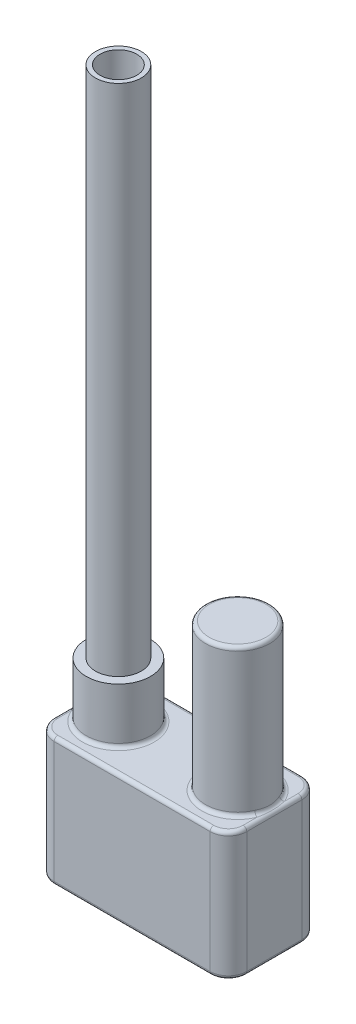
ISO-10303-21;
HEADER;
FILE_DESCRIPTION(('STEP AP214'),'2;1');
FILE_NAME('part.step','',(''),(''),'','','');
FILE_SCHEMA(('AUTOMOTIVE_DESIGN { 1 0 10303 214 1 1 1 1 }'));
ENDSEC;
DATA;
#1=APPLICATION_CONTEXT('core data for automotive mechanical design processes');
#2=APPLICATION_PROTOCOL_DEFINITION('international standard','automotive_design',2000,#1);
#3=PRODUCT_CONTEXT('',#1,'mechanical');
#4=PRODUCT('Part','Part','',(#3));
#5=PRODUCT_RELATED_PRODUCT_CATEGORY('part','',(#4));
#6=PRODUCT_DEFINITION_FORMATION('','',#4);
#7=PRODUCT_DEFINITION_CONTEXT('part definition',#1,'design');
#8=PRODUCT_DEFINITION('design','',#6,#7);
#9=PRODUCT_DEFINITION_SHAPE('','',#8);
#10=(LENGTH_UNIT() NAMED_UNIT(*) SI_UNIT(.MILLI.,.METRE.));
#11=(NAMED_UNIT(*) PLANE_ANGLE_UNIT() SI_UNIT($,.RADIAN.));
#12=(NAMED_UNIT(*) SI_UNIT($,.STERADIAN.) SOLID_ANGLE_UNIT());
#13=UNCERTAINTY_MEASURE_WITH_UNIT(LENGTH_MEASURE(1.E-05),#10,'distance_accuracy_value','');
#14=(GEOMETRIC_REPRESENTATION_CONTEXT(3) GLOBAL_UNCERTAINTY_ASSIGNED_CONTEXT((#13)) GLOBAL_UNIT_ASSIGNED_CONTEXT((#10,
#11,#12)) REPRESENTATION_CONTEXT('',''));
#15=CARTESIAN_POINT('',(0.,0.,0.));
#16=DIRECTION('',(0.,0.,1.));
#17=DIRECTION('',(1.,0.,0.));
#18=AXIS2_PLACEMENT_3D('',#15,#16,#17);
#19=CARTESIAN_POINT('',(-85.0000000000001,30.0000000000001,25.));
#20=DIRECTION('',(0.,1.,0.));
#21=DIRECTION('',(0.,0.,1.));
#22=AXIS2_PLACEMENT_3D('',#19,#20,#21);
#23=PLANE('',#22);
#24=CARTESIAN_POINT('',(-85.0000000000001,30.0000000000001,25.));
#25=DIRECTION('',(0.,1.,0.));
#26=DIRECTION('',(0.,0.,1.));
#27=AXIS2_PLACEMENT_3D('',#24,#25,#26);
#28=CIRCLE('',#27,17.5);
#29=CARTESIAN_POINT('',(-85.0000000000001,30.0000000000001,42.5));
#30=VERTEX_POINT('',#29);
#31=EDGE_CURVE('E402',#30,#30,#28,.T.);
#32=ORIENTED_EDGE('',*,*,#31,.T.);
#33=EDGE_LOOP('',(#32));
#34=FACE_BOUND('',#33,.T.);
#35=CARTESIAN_POINT('',(-85.0000000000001,30.0000000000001,25.));
#36=DIRECTION('',(0.,1.,0.));
#37=DIRECTION('',(0.,0.,1.));
#38=AXIS2_PLACEMENT_3D('',#35,#36,#37);
#39=CIRCLE('',#38,12.5);
#40=CARTESIAN_POINT('',(-85.0000000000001,30.0000000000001,37.5));
#41=VERTEX_POINT('',#40);
#42=EDGE_CURVE('E453',#41,#41,#39,.T.);
#43=ORIENTED_EDGE('',*,*,#42,.F.);
#44=EDGE_LOOP('',(#43));
#45=FACE_BOUND('',#44,.T.);
#46=ADVANCED_FACE('F34',(#34,#45),#23,.T.);
#47=CARTESIAN_POINT('',(-105.,1.11022302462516E-13,50.));
#48=DIRECTION('',(0.,-1.,0.));
#49=DIRECTION('',(0.,0.,-1.));
#50=AXIS2_PLACEMENT_3D('',#47,#48,#49);
#51=PLANE('',#50);
#52=DIRECTION('',(0.,0.,-1.));
#53=VECTOR('',#52,1.);
#54=CARTESIAN_POINT('',(-103.,1.66533453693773E-13,50.));
#55=LINE('',#54,#53);
#56=CARTESIAN_POINT('',(-103.,0.,9.99999999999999));
#57=VERTEX_POINT('',#56);
#58=CARTESIAN_POINT('',(-103.,1.11022302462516E-13,17.5));
#59=VERTEX_POINT('',#58);
#60=EDGE_CURVE('E179',#57,#59,#55,.F.);
#61=ORIENTED_EDGE('',*,*,#60,.T.);
#62=CARTESIAN_POINT('',(-85.0000000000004,1.66533453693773E-13,25.));
#63=DIRECTION('',(0.,-1.,0.));
#64=DIRECTION('',(0.,0.,-1.));
#65=AXIS2_PLACEMENT_3D('',#62,#63,#64);
#66=CIRCLE('',#65,19.5);
#67=CARTESIAN_POINT('',(-103.,1.94289029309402E-13,32.5));
#68=VERTEX_POINT('',#67);
#69=EDGE_CURVE('E47',#59,#68,#66,.T.);
#70=ORIENTED_EDGE('',*,*,#69,.T.);
#71=CARTESIAN_POINT('',(-103.,0.,40.));
#72=VERTEX_POINT('',#71);
#73=EDGE_CURVE('E198',#68,#72,#55,.F.);
#74=ORIENTED_EDGE('',*,*,#73,.T.);
#75=CARTESIAN_POINT('',(-95.0000000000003,1.66533453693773E-13,40.));
#76=DIRECTION('',(0.,-1.,0.));
#77=DIRECTION('',(0.,0.,-1.));
#78=AXIS2_PLACEMENT_3D('',#75,#76,#77);
#79=CIRCLE('',#78,8.);
#80=CARTESIAN_POINT('',(-95.0000000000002,0.,48.));
#81=VERTEX_POINT('',#80);
#82=EDGE_CURVE('E185',#72,#81,#79,.F.);
#83=ORIENTED_EDGE('',*,*,#82,.T.);
#84=DIRECTION('',(-1.,0.,0.));
#85=VECTOR('',#84,1.);
#86=CARTESIAN_POINT('',(-10.0000000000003,1.11022302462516E-13,48.));
#87=LINE('',#86,#85);
#88=CARTESIAN_POINT('',(-10.0000000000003,1.11022302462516E-13,48.));
#89=VERTEX_POINT('',#88);
#90=EDGE_CURVE('E206',#81,#89,#87,.F.);
#91=ORIENTED_EDGE('',*,*,#90,.T.);
#92=CARTESIAN_POINT('',(-10.0000000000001,2.22044604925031E-13,40.));
#93=DIRECTION('',(0.,-1.,0.));
#94=DIRECTION('',(0.,0.,-1.));
#95=AXIS2_PLACEMENT_3D('',#92,#93,#94);
#96=CIRCLE('',#95,8.);
#97=CARTESIAN_POINT('',(-2.00000000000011,0.,40.));
#98=VERTEX_POINT('',#97);
#99=EDGE_CURVE('E210',#89,#98,#96,.F.);
#100=ORIENTED_EDGE('',*,*,#99,.T.);
#101=DIRECTION('',(0.,0.,-1.));
#102=VECTOR('',#101,1.);
#103=CARTESIAN_POINT('',(-2.00000000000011,1.66533453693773E-13,50.));
#104=LINE('',#103,#102);
#105=CARTESIAN_POINT('',(-2.00000000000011,1.38777878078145E-13,32.5));
#106=VERTEX_POINT('',#105);
#107=EDGE_CURVE('E214',#98,#106,#104,.T.);
#108=ORIENTED_EDGE('',*,*,#107,.T.);
#109=CARTESIAN_POINT('',(-20.0000000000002,1.66533453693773E-13,25.));
#110=DIRECTION('',(0.,-1.,0.));
#111=DIRECTION('',(0.,0.,-1.));
#112=AXIS2_PLACEMENT_3D('',#109,#110,#111);
#113=CIRCLE('',#112,19.5);
#114=CARTESIAN_POINT('',(-2.00000000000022,1.11022302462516E-13,17.5));
#115=VERTEX_POINT('',#114);
#116=EDGE_CURVE('E283',#106,#115,#113,.T.);
#117=ORIENTED_EDGE('',*,*,#116,.T.);
#118=CARTESIAN_POINT('',(-2.00000000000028,1.11022302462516E-13,10.));
#119=VERTEX_POINT('',#118);
#120=EDGE_CURVE('E213',#115,#119,#104,.T.);
#121=ORIENTED_EDGE('',*,*,#120,.T.);
#122=CARTESIAN_POINT('',(-10.0000000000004,1.11022302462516E-13,9.99999999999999));
#123=DIRECTION('',(0.,-1.,0.));
#124=DIRECTION('',(0.,0.,-1.));
#125=AXIS2_PLACEMENT_3D('',#122,#123,#124);
#126=CIRCLE('',#125,8.);
#127=CARTESIAN_POINT('',(-10.0000000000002,1.38777878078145E-13,2.00000000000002));
#128=VERTEX_POINT('',#127);
#129=EDGE_CURVE('E208',#119,#128,#126,.F.);
#130=ORIENTED_EDGE('',*,*,#129,.T.);
#131=DIRECTION('',(-1.,0.,0.));
#132=VECTOR('',#131,1.);
#133=CARTESIAN_POINT('',(-105.,0.,2.00000000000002));
#134=LINE('',#133,#132);
#135=CARTESIAN_POINT('',(-95.0000000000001,1.66533453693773E-13,2.00000000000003));
#136=VERTEX_POINT('',#135);
#137=EDGE_CURVE('E181',#128,#136,#134,.T.);
#138=ORIENTED_EDGE('',*,*,#137,.T.);
#139=CARTESIAN_POINT('',(-95.0000000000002,1.38777878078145E-13,10.));
#140=DIRECTION('',(0.,-1.,0.));
#141=DIRECTION('',(0.,0.,-1.));
#142=AXIS2_PLACEMENT_3D('',#139,#140,#141);
#143=CIRCLE('',#142,8.);
#144=EDGE_CURVE('E175',#136,#57,#143,.F.);
#145=ORIENTED_EDGE('',*,*,#144,.T.);
#146=EDGE_LOOP('',(#61,#70,#74,#83,#91,#100,#108,#117,#121,#130,#138,#145));
#147=FACE_BOUND('',#146,.T.);
#148=ADVANCED_FACE('F177',(#147),#51,.F.);
#149=CARTESIAN_POINT('',(-105.,1.11022302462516E-13,50.));
#150=DIRECTION('',(1.,0.,0.));
#151=DIRECTION('',(0.,1.,0.));
#152=AXIS2_PLACEMENT_3D('',#149,#150,#151);
#153=PLANE('',#152);
#154=DIRECTION('',(0.,-1.,0.));
#155=VECTOR('',#154,1.);
#156=CARTESIAN_POINT('',(-105.,0.,40.));
#157=LINE('',#156,#155);
#158=CARTESIAN_POINT('',(-105.,-68.0000000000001,40.));
#159=VERTEX_POINT('',#158);
#160=CARTESIAN_POINT('',(-105.,-1.99999999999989,40.));
#161=VERTEX_POINT('',#160);
#162=EDGE_CURVE('E200',#159,#161,#157,.F.);
#163=ORIENTED_EDGE('',*,*,#162,.T.);
#164=DIRECTION('',(0.,0.,-1.));
#165=VECTOR('',#164,1.);
#166=CARTESIAN_POINT('',(-105.,-1.99999999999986,50.));
#167=LINE('',#166,#165);
#168=CARTESIAN_POINT('',(-105.,-1.99999999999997,10.));
#169=VERTEX_POINT('',#168);
#170=EDGE_CURVE('E265',#161,#169,#167,.T.);
#171=ORIENTED_EDGE('',*,*,#170,.T.);
#172=DIRECTION('',(0.,-1.,0.));
#173=VECTOR('',#172,1.);
#174=CARTESIAN_POINT('',(-105.,0.,9.99999999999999));
#175=LINE('',#174,#173);
#176=CARTESIAN_POINT('',(-105.,-67.9999999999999,10.));
#177=VERTEX_POINT('',#176);
#178=EDGE_CURVE('E424',#169,#177,#175,.T.);
#179=ORIENTED_EDGE('',*,*,#178,.T.);
#180=DIRECTION('',(0.,0.,-1.));
#181=VECTOR('',#180,1.);
#182=CARTESIAN_POINT('',(-105.,-67.9999999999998,50.));
#183=LINE('',#182,#181);
#184=EDGE_CURVE('E263',#177,#159,#183,.F.);
#185=ORIENTED_EDGE('',*,*,#184,.T.);
#186=EDGE_LOOP('',(#163,#171,#179,#185));
#187=FACE_BOUND('',#186,.T.);
#188=ADVANCED_FACE('F293',(#187),#153,.F.);
#189=CARTESIAN_POINT('',(-105.,-70.0000000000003,50.));
#190=DIRECTION('',(0.,1.,0.));
#191=DIRECTION('',(0.,0.,1.));
#192=AXIS2_PLACEMENT_3D('',#189,#190,#191);
#193=PLANE('',#192);
#194=CARTESIAN_POINT('',(-10.0000000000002,-70.,40.));
#195=DIRECTION('',(0.,1.,0.));
#196=DIRECTION('',(0.,0.,1.));
#197=AXIS2_PLACEMENT_3D('',#194,#195,#196);
#198=CIRCLE('',#197,8.);
#199=CARTESIAN_POINT('',(-2.00000000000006,-70.0000000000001,40.));
#200=VERTEX_POINT('',#199);
#201=CARTESIAN_POINT('',(-10.0000000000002,-70.,48.));
#202=VERTEX_POINT('',#201);
#203=EDGE_CURVE('E246',#200,#202,#198,.F.);
#204=ORIENTED_EDGE('',*,*,#203,.T.);
#205=DIRECTION('',(1.,0.,0.));
#206=VECTOR('',#205,1.);
#207=CARTESIAN_POINT('',(-95.0000000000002,-69.9999999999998,48.));
#208=LINE('',#207,#206);
#209=CARTESIAN_POINT('',(-95.0000000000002,-69.9999999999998,48.));
#210=VERTEX_POINT('',#209);
#211=EDGE_CURVE('E249',#202,#210,#208,.F.);
#212=ORIENTED_EDGE('',*,*,#211,.T.);
#213=CARTESIAN_POINT('',(-95.0000000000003,-70.,40.));
#214=DIRECTION('',(0.,1.,0.));
#215=DIRECTION('',(0.,0.,1.));
#216=AXIS2_PLACEMENT_3D('',#213,#214,#215);
#217=CIRCLE('',#216,8.);
#218=CARTESIAN_POINT('',(-103.,-69.9999999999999,40.));
#219=VERTEX_POINT('',#218);
#220=EDGE_CURVE('E244',#210,#219,#217,.F.);
#221=ORIENTED_EDGE('',*,*,#220,.T.);
#222=DIRECTION('',(0.,0.,-1.));
#223=VECTOR('',#222,1.);
#224=CARTESIAN_POINT('',(-103.,-69.9999999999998,50.));
#225=LINE('',#224,#223);
#226=CARTESIAN_POINT('',(-103.,-69.9999999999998,9.99999999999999));
#227=VERTEX_POINT('',#226);
#228=EDGE_CURVE('E240',#219,#227,#225,.T.);
#229=ORIENTED_EDGE('',*,*,#228,.T.);
#230=CARTESIAN_POINT('',(-95.0000000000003,-70.,9.99999999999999));
#231=DIRECTION('',(0.,1.,0.));
#232=DIRECTION('',(0.,0.,1.));
#233=AXIS2_PLACEMENT_3D('',#230,#231,#232);
#234=CIRCLE('',#233,8.);
#235=CARTESIAN_POINT('',(-95.0000000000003,-70.,2.00000000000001));
#236=VERTEX_POINT('',#235);
#237=EDGE_CURVE('E238',#227,#236,#234,.F.);
#238=ORIENTED_EDGE('',*,*,#237,.T.);
#239=DIRECTION('',(1.,0.,0.));
#240=VECTOR('',#239,1.);
#241=CARTESIAN_POINT('',(-105.,-70.,1.99999999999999));
#242=LINE('',#241,#240);
#243=CARTESIAN_POINT('',(-10.0000000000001,-70.0000000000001,2.));
#244=VERTEX_POINT('',#243);
#245=EDGE_CURVE('E234',#236,#244,#242,.T.);
#246=ORIENTED_EDGE('',*,*,#245,.T.);
#247=CARTESIAN_POINT('',(-10.0000000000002,-70.,10.));
#248=DIRECTION('',(0.,1.,0.));
#249=DIRECTION('',(0.,0.,1.));
#250=AXIS2_PLACEMENT_3D('',#247,#248,#249);
#251=CIRCLE('',#250,8.);
#252=CARTESIAN_POINT('',(-2.0000000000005,-70.0000000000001,9.99999999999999));
#253=VERTEX_POINT('',#252);
#254=EDGE_CURVE('E236',#244,#253,#251,.F.);
#255=ORIENTED_EDGE('',*,*,#254,.T.);
#256=DIRECTION('',(0.,0.,-1.));
#257=VECTOR('',#256,1.);
#258=CARTESIAN_POINT('',(-2.00000000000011,-70.,50.));
#259=LINE('',#258,#257);
#260=EDGE_CURVE('E242',#253,#200,#259,.F.);
#261=ORIENTED_EDGE('',*,*,#260,.T.);
#262=EDGE_LOOP('',(#204,#212,#221,#229,#238,#246,#255,#261));
#263=FACE_BOUND('',#262,.T.);
#264=ADVANCED_FACE('F704',(#263),#193,.F.);
#265=CARTESIAN_POINT('',(-1.66533453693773E-13,1.66533453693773E-13,50.));
#266=DIRECTION('',(-1.,0.,0.));
#267=DIRECTION('',(0.,-1.,0.));
#268=AXIS2_PLACEMENT_3D('',#265,#266,#267);
#269=PLANE('',#268);
#270=DIRECTION('',(0.,1.,0.));
#271=VECTOR('',#270,1.);
#272=CARTESIAN_POINT('',(-2.77555756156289E-13,1.11022302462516E-13,9.99999999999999));
#273=LINE('',#272,#271);
#274=CARTESIAN_POINT('',(-2.77555756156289E-13,-67.9999999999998,10.));
#275=VERTEX_POINT('',#274);
#276=CARTESIAN_POINT('',(-2.22044604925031E-13,-1.99999999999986,9.99999999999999));
#277=VERTEX_POINT('',#276);
#278=EDGE_CURVE('E413',#275,#277,#273,.T.);
#279=ORIENTED_EDGE('',*,*,#278,.T.);
#280=DIRECTION('',(0.,0.,-1.));
#281=VECTOR('',#280,1.);
#282=CARTESIAN_POINT('',(-1.11022302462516E-13,-1.99999999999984,50.));
#283=LINE('',#282,#281);
#284=CARTESIAN_POINT('',(-3.33066907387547E-13,-1.99999999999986,40.));
#285=VERTEX_POINT('',#284);
#286=EDGE_CURVE('E261',#277,#285,#283,.F.);
#287=ORIENTED_EDGE('',*,*,#286,.T.);
#288=DIRECTION('',(0.,1.,0.));
#289=VECTOR('',#288,1.);
#290=CARTESIAN_POINT('',(-2.22044604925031E-13,-69.9999999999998,40.));
#291=LINE('',#290,#289);
#292=CARTESIAN_POINT('',(0.,-67.9999999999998,40.));
#293=VERTEX_POINT('',#292);
#294=EDGE_CURVE('E405',#285,#293,#291,.F.);
#295=ORIENTED_EDGE('',*,*,#294,.T.);
#296=DIRECTION('',(0.,0.,-1.));
#297=VECTOR('',#296,1.);
#298=CARTESIAN_POINT('',(-1.66533453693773E-13,-67.9999999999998,50.));
#299=LINE('',#298,#297);
#300=EDGE_CURVE('E259',#293,#275,#299,.T.);
#301=ORIENTED_EDGE('',*,*,#300,.T.);
#302=EDGE_LOOP('',(#279,#287,#295,#301));
#303=FACE_BOUND('',#302,.T.);
#304=ADVANCED_FACE('F696',(#303),#269,.F.);
#305=CARTESIAN_POINT('',(-105.,-70.0000000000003,50.));
#306=DIRECTION('',(0.,0.,1.));
#307=DIRECTION('',(1.,0.,0.));
#308=AXIS2_PLACEMENT_3D('',#305,#306,#307);
#309=PLANE('',#308);
#310=DIRECTION('',(0.,1.,0.));
#311=VECTOR('',#310,1.);
#312=CARTESIAN_POINT('',(-10.0000000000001,0.,50.));
#313=LINE('',#312,#311);
#314=CARTESIAN_POINT('',(-10.0000000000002,-67.9999999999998,50.));
#315=VERTEX_POINT('',#314);
#316=CARTESIAN_POINT('',(-10.0000000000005,-1.99999999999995,50.));
#317=VERTEX_POINT('',#316);
#318=EDGE_CURVE('E401',#315,#317,#313,.T.);
#319=ORIENTED_EDGE('',*,*,#318,.T.);
#320=DIRECTION('',(-1.,0.,0.));
#321=VECTOR('',#320,1.);
#322=CARTESIAN_POINT('',(-95.0000000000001,-2.00000000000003,50.));
#323=LINE('',#322,#321);
#324=CARTESIAN_POINT('',(-95.0000000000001,-2.00000000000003,50.));
#325=VERTEX_POINT('',#324);
#326=EDGE_CURVE('E253',#317,#325,#323,.T.);
#327=ORIENTED_EDGE('',*,*,#326,.T.);
#328=DIRECTION('',(0.,-1.,0.));
#329=VECTOR('',#328,1.);
#330=CARTESIAN_POINT('',(-95.0000000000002,-69.9999999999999,50.));
#331=LINE('',#330,#329);
#332=CARTESIAN_POINT('',(-95.0000000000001,-67.9999999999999,50.));
#333=VERTEX_POINT('',#332);
#334=EDGE_CURVE('E422',#325,#333,#331,.T.);
#335=ORIENTED_EDGE('',*,*,#334,.T.);
#336=DIRECTION('',(1.,0.,0.));
#337=VECTOR('',#336,1.);
#338=CARTESIAN_POINT('',(-10.0000000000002,-67.9999999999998,50.));
#339=LINE('',#338,#337);
#340=EDGE_CURVE('E251',#333,#315,#339,.T.);
#341=ORIENTED_EDGE('',*,*,#340,.T.);
#342=EDGE_LOOP('',(#319,#327,#335,#341));
#343=FACE_BOUND('',#342,.T.);
#344=ADVANCED_FACE('F689',(#343),#309,.T.);
#345=CARTESIAN_POINT('',(-105.,-70.,0.));
#346=DIRECTION('',(0.,0.,1.));
#347=DIRECTION('',(1.,0.,0.));
#348=AXIS2_PLACEMENT_3D('',#345,#346,#347);
#349=PLANE('',#348);
#350=DIRECTION('',(0.,-1.,0.));
#351=VECTOR('',#350,1.);
#352=CARTESIAN_POINT('',(-95.0000000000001,-70.,0.));
#353=LINE('',#352,#351);
#354=CARTESIAN_POINT('',(-95.0000000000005,-67.9999999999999,0.));
#355=VERTEX_POINT('',#354);
#356=CARTESIAN_POINT('',(-95.0000000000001,-2.,0.));
#357=VERTEX_POINT('',#356);
#358=EDGE_CURVE('E416',#355,#357,#353,.F.);
#359=ORIENTED_EDGE('',*,*,#358,.T.);
#360=DIRECTION('',(-1.,0.,0.));
#361=VECTOR('',#360,1.);
#362=CARTESIAN_POINT('',(-105.,-1.99999999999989,0.));
#363=LINE('',#362,#361);
#364=CARTESIAN_POINT('',(-10.0000000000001,-1.99999999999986,0.));
#365=VERTEX_POINT('',#364);
#366=EDGE_CURVE('E257',#357,#365,#363,.F.);
#367=ORIENTED_EDGE('',*,*,#366,.T.);
#368=DIRECTION('',(0.,1.,0.));
#369=VECTOR('',#368,1.);
#370=CARTESIAN_POINT('',(-10.0000000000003,-70.,0.));
#371=LINE('',#370,#369);
#372=CARTESIAN_POINT('',(-10.0000000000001,-68.,0.));
#373=VERTEX_POINT('',#372);
#374=EDGE_CURVE('E419',#365,#373,#371,.F.);
#375=ORIENTED_EDGE('',*,*,#374,.T.);
#376=DIRECTION('',(1.,0.,0.));
#377=VECTOR('',#376,1.);
#378=CARTESIAN_POINT('',(-105.,-68.0000000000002,0.));
#379=LINE('',#378,#377);
#380=EDGE_CURVE('E255',#373,#355,#379,.F.);
#381=ORIENTED_EDGE('',*,*,#380,.T.);
#382=EDGE_LOOP('',(#359,#367,#375,#381));
#383=FACE_BOUND('',#382,.T.);
#384=ADVANCED_FACE('F482',(#383),#349,.F.);
#385=CARTESIAN_POINT('',(-20.0000000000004,30.0000000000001,25.));
#386=DIRECTION('',(0.,-1.,0.));
#387=DIRECTION('',(0.,0.,-1.));
#388=AXIS2_PLACEMENT_3D('',#385,#386,#387);
#389=CYLINDRICAL_SURFACE('',#388,17.5);
#390=CARTESIAN_POINT('',(-20.0000000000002,2.0000000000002,25.));
#391=DIRECTION('',(0.,-1.,0.));
#392=DIRECTION('',(0.,0.,-1.));
#393=AXIS2_PLACEMENT_3D('',#390,#391,#392);
#394=CIRCLE('',#393,17.5);
#395=CARTESIAN_POINT('',(-3.846153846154,2.00000000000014,18.2692307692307));
#396=VERTEX_POINT('',#395);
#397=CARTESIAN_POINT('',(-3.84615384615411,2.00000000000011,31.7307692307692));
#398=VERTEX_POINT('',#397);
#399=EDGE_CURVE('E273',#396,#398,#394,.F.);
#400=ORIENTED_EDGE('',*,*,#399,.T.);
#401=CARTESIAN_POINT('',(-5.57033418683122,1.50840093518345,34.9012496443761));
#402=CARTESIAN_POINT('',(-5.0611862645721,-1.39608995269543,34.1592388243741));
#403=CARTESIAN_POINT('',(-2.96061476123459,-0.24579953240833,36.0328210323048));
#404=CARTESIAN_POINT('',(-5.50642734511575,1.54738513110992,34.8081205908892));
#405=CARTESIAN_POINT('',(-5.03689320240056,-1.32792287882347,34.1136854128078));
#406=CARTESIAN_POINT('',(-2.9250095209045,-0.226307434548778,35.9290486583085));
#407=CARTESIAN_POINT('',(-5.44296757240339,1.58330271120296,34.7136976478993));
#408=CARTESIAN_POINT('',(-5.00919359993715,-1.26096846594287,34.0631224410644));
#409=CARTESIAN_POINT('',(-2.88965336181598,-0.208348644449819,35.8238345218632));
#410=CARTESIAN_POINT('',(-5.31722856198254,1.64952720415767,34.5225668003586));
#411=CARTESIAN_POINT('',(-4.94866276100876,-1.13169001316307,33.9537340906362));
#412=CARTESIAN_POINT('',(-2.81959877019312,-0.175236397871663,35.6108601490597));
#413=CARTESIAN_POINT('',(-5.2549488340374,1.67983649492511,34.4258598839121));
#414=CARTESIAN_POINT('',(-4.91592445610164,-1.06924687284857,33.8950560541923));
#415=CARTESIAN_POINT('',(-2.78490006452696,-0.160081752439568,35.5031010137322));
#416=CARTESIAN_POINT('',(-5.07046746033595,1.76307246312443,34.1330267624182));
#417=CARTESIAN_POINT('',(-4.81292523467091,-0.89136552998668,33.7100056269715));
#418=CARTESIAN_POINT('',(-2.68211758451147,-0.118463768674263,35.176801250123));
#419=CARTESIAN_POINT('',(-4.95037309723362,1.80845462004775,33.9338239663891));
#420=CARTESIAN_POINT('',(-4.73613368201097,-0.780963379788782,33.5715125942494));
#421=CARTESIAN_POINT('',(-2.61520786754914,-0.0957726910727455,34.95483242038));
#422=CARTESIAN_POINT('',(-4.71820457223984,1.88248988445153,33.5305632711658));
#423=CARTESIAN_POINT('',(-4.57518059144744,-0.581709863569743,33.2727255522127));
#424=CARTESIAN_POINT('',(-2.48585683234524,-0.0587550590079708,34.5054847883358));
#425=CARTESIAN_POINT('',(-4.60607597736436,1.91126858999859,33.3265543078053));
#426=CARTESIAN_POINT('',(-4.49119391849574,-0.491835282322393,33.113084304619));
#427=CARTESIAN_POINT('',(-2.42338518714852,-0.0443657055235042,34.2781605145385));
#428=CARTESIAN_POINT('',(-4.38961013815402,1.95579695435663,32.9132893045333));
#429=CARTESIAN_POINT('',(-4.32079201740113,-0.330887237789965,32.7762238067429));
#430=CARTESIAN_POINT('',(-2.30278279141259,-0.0221015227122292,33.8176652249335));
#431=CARTESIAN_POINT('',(-4.28527472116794,1.9715435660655,32.7040320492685));
#432=CARTESIAN_POINT('',(-4.23425970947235,-0.259083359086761,32.5991485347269));
#433=CARTESIAN_POINT('',(-2.24465305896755,-0.0142282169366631,33.5844928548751));
#434=CARTESIAN_POINT('',(-4.12565751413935,1.98841112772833,32.3671263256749));
#435=CARTESIAN_POINT('',(-4.09672673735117,-0.1572783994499,32.3044373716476));
#436=CARTESIAN_POINT('',(-2.15572347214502,-0.00579443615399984,33.209083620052));
#437=CARTESIAN_POINT('',(-4.06767118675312,1.99287515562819,32.2408700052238));
#438=CARTESIAN_POINT('',(-4.04595887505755,-0.122313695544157,32.1928331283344));
#439=CARTESIAN_POINT('',(-2.12341680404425,-0.00356242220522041,33.0683980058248));
#440=CARTESIAN_POINT('',(-3.95466378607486,1.99866811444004,31.9868824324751));
#441=CARTESIAN_POINT('',(-3.94540641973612,-0.0575696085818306,31.965324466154));
#442=CARTESIAN_POINT('',(-2.06045553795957,-0.000665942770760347,32.7853832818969));
#443=CARTESIAN_POINT('',(-3.89964473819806,1.99999492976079,31.8591502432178));
#444=CARTESIAN_POINT('',(-3.89556728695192,-0.0276914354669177,31.8493879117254));
#445=CARTESIAN_POINT('',(-2.02980206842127,-2.53508068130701E-06,32.6430531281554));
#446=CARTESIAN_POINT('',(-3.66529677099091,2.00001714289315,31.2967025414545));
#447=CARTESIAN_POINT('',(-3.68400251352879,0.0908700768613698,31.3415193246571));
#448=CARTESIAN_POINT('',(-1.89923677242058,8.57131496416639E-06,32.0163256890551));
#449=CARTESIAN_POINT('',(-3.50190913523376,1.98492447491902,30.8552186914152));
#450=CARTESIAN_POINT('',(-3.52530528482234,0.158774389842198,30.920577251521));
#451=CARTESIAN_POINT('',(-1.80820651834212,-0.00753776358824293,31.5243865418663));
#452=CARTESIAN_POINT('',(-3.21126583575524,1.94032918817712,29.9608471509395));
#453=CARTESIAN_POINT('',(-3.23900717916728,0.257085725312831,30.0526353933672));
#454=CARTESIAN_POINT('',(-1.64627668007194,-0.0298354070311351,30.5278011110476));
#455=CARTESIAN_POINT('',(-3.08404832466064,1.9108114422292,29.5079479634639));
#456=CARTESIAN_POINT('',(-3.10914588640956,0.289153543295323,29.6027518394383));
#457=CARTESIAN_POINT('',(-1.57539835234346,-0.0445942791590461,30.0231420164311));
#458=CARTESIAN_POINT('',(-2.86623009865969,1.85012019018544,28.5924508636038));
#459=CARTESIAN_POINT('',(-2.88599244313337,0.331838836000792,28.6859476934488));
#460=CARTESIAN_POINT('',(-1.45404248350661,-0.0749399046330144,29.0030166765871));
#461=CARTESIAN_POINT('',(-2.77570877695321,1.81894325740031,28.1298341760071));
#462=CARTESIAN_POINT('',(-2.79093349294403,0.343119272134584,28.2155293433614));
#463=CARTESIAN_POINT('',(-1.40360917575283,-0.090528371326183,28.4875295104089));
#464=CARTESIAN_POINT('',(-2.63227091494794,1.76531471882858,27.19859252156));
#465=CARTESIAN_POINT('',(-2.64068997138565,0.356113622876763,27.2661837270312));
#466=CARTESIAN_POINT('',(-1.32369379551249,-0.117342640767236,27.4498602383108));
#467=CARTESIAN_POINT('',(-2.57933667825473,1.74285900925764,26.7299704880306));
#468=CARTESIAN_POINT('',(-2.58423680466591,0.358036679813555,26.7834734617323));
#469=CARTESIAN_POINT('',(-1.29420186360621,-0.128570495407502,26.9276814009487));
#470=CARTESIAN_POINT('',(-2.51146418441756,1.71346928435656,25.7895166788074));
#471=CARTESIAN_POINT('',(-2.51234839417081,0.359832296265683,25.8160530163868));
#472=CARTESIAN_POINT('',(-1.25638718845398,-0.143265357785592,25.879747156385));
#473=CARTESIAN_POINT('',(-2.49652836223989,1.70653626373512,25.3176846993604));
#474=CARTESIAN_POINT('',(-2.49631406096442,0.359727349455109,25.3273465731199));
#475=CARTESIAN_POINT('',(-1.2480658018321,-0.146731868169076,25.3539915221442));
#476=CARTESIAN_POINT('',(-2.50482676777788,1.71027287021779,24.3743262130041));
#477=CARTESIAN_POINT('',(-2.50512950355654,0.359661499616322,24.3546281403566));
#478=CARTESIAN_POINT('',(-1.25268919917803,-0.144863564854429,24.3028206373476));
#479=CARTESIAN_POINT('',(-2.52806855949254,1.72094598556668,23.9027997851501));
#480=CARTESIAN_POINT('',(-2.53006136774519,0.359700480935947,23.8665574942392));
#481=CARTESIAN_POINT('',(-1.26563819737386,-0.139527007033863,23.777405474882));
#482=CARTESIAN_POINT('',(-2.61247089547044,1.75669286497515,22.9638297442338));
#483=CARTESIAN_POINT('',(-2.61930766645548,0.356605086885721,22.9019722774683));
#484=CARTESIAN_POINT('',(-1.3126623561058,-0.12165356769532,22.7311245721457));
#485=CARTESIAN_POINT('',(-2.67361673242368,1.78176104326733,22.4963846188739));
#486=CARTESIAN_POINT('',(-2.68435290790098,0.353429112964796,22.4214902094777));
#487=CARTESIAN_POINT('',(-1.34672932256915,-0.109119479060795,22.2102571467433));
#488=CARTESIAN_POINT('',(-2.83328701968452,1.8386047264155,21.5684396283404));
#489=CARTESIAN_POINT('',(-2.85097782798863,0.335839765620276,21.4783528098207));
#490=CARTESIAN_POINT('',(-1.43568848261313,-0.0806976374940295,21.176261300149));
#491=CARTESIAN_POINT('',(-2.93180054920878,1.87037827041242,21.1079377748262));
#492=CARTESIAN_POINT('',(-2.95393041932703,0.321148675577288,21.0119676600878));
#493=CARTESIAN_POINT('',(-1.49057459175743,-0.0648108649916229,20.6631306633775));
#494=CARTESIAN_POINT('',(-3.15294213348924,1.9265127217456,20.2457935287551));
#495=CARTESIAN_POINT('',(-3.17862390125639,0.271714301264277,20.1545311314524));
#496=CARTESIAN_POINT('',(-1.61378204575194,-0.0367436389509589,19.7024556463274));
#497=CARTESIAN_POINT('',(-3.27177410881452,1.95130407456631,19.8432040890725));
#498=CARTESIAN_POINT('',(-3.29884756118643,0.238613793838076,19.7571793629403));
#499=CARTESIAN_POINT('',(-1.67998843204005,-0.0243479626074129,19.2538559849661));
#500=CARTESIAN_POINT('',(-3.47139862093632,1.97883806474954,19.2468150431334));
#501=CARTESIAN_POINT('',(-3.49270176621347,0.168208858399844,19.1857976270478));
#502=CARTESIAN_POINT('',(-1.7912078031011,-0.0105809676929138,18.5893081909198));
#503=CARTESIAN_POINT('',(-3.54139028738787,1.98640335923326,19.0495381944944));
#504=CARTESIAN_POINT('',(-3.56054874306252,0.140815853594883,18.9970214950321));
#505=CARTESIAN_POINT('',(-1.83020316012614,-0.00679832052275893,18.3694854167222));
#506=CARTESIAN_POINT('',(-3.68847667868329,1.99698408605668,18.657440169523));
#507=CARTESIAN_POINT('',(-3.70057860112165,0.0773333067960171,18.6266512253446));
#508=CARTESIAN_POINT('',(-1.91215129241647,-0.00150795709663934,17.9325761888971));
#509=CARTESIAN_POINT('',(-3.76557454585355,1.99999749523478,18.4626201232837));
#510=CARTESIAN_POINT('',(-3.77297060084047,0.0410200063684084,18.4448612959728));
#511=CARTESIAN_POINT('',(-1.95510581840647,-1.25242140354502E-06,17.7154909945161));
#512=CARTESIAN_POINT('',(-3.96255558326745,2.00000361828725,17.9898679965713));
#513=CARTESIAN_POINT('',(-3.95458962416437,-0.0607794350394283,18.0089986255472));
#514=CARTESIAN_POINT('',(-2.06485239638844,1.80919953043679E-06,17.1887100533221));
#515=CARTESIAN_POINT('',(-4.08622222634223,1.99372420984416,17.7134907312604));
#516=CARTESIAN_POINT('',(-4.06520233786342,-0.13214483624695,17.7612452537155));
#517=CARTESIAN_POINT('',(-2.13375238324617,-0.00313789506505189,16.8807468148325));
#518=CARTESIAN_POINT('',(-4.34735771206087,1.96352041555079,17.16827111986));
#519=CARTESIAN_POINT('',(-4.28733173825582,-0.300740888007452,17.2895993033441));
#520=CARTESIAN_POINT('',(-2.27924215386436,-0.0182397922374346,16.2732163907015));
#521=CARTESIAN_POINT('',(-4.48481488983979,1.93961083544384,16.8994226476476));
#522=CARTESIAN_POINT('',(-4.39932915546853,-0.399236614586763,17.0656076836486));
#523=CARTESIAN_POINT('',(-2.35582543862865,-0.0301945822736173,15.9736423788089));
#524=CARTESIAN_POINT('',(-4.70129807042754,1.88573074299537,16.5015919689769));
#525=CARTESIAN_POINT('',(-4.56073949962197,-0.568187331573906,16.7551434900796));
#526=CARTESIAN_POINT('',(-2.4764374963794,-0.0571346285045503,15.5303453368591));
#527=CARTESIAN_POINT('',(-4.77566727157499,1.86458041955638,16.3690876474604));
#528=CARTESIAN_POINT('',(-4.6146030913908,-0.629670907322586,16.6538746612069));
#529=CARTESIAN_POINT('',(-2.517871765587,-0.0677097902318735,15.3826976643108));
#530=CARTESIAN_POINT('',(-4.9273434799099,1.81527440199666,16.106859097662));
#531=CARTESIAN_POINT('',(-4.71888099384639,-0.760691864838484,16.4607952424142));
#532=CARTESIAN_POINT('',(-2.60237708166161,-0.0923627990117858,15.0905001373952));
#533=CARTESIAN_POINT('',(-5.0046498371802,1.78712025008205,15.9771342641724));
#534=CARTESIAN_POINT('',(-4.76926586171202,-0.830475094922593,16.3691093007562));
#535=CARTESIAN_POINT('',(-2.64544776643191,-0.106439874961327,14.9459496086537));
#536=CARTESIAN_POINT('',(-5.16214002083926,1.72270042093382,15.7204185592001));
#537=CARTESIAN_POINT('',(-4.86486638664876,-0.978416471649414,16.1964778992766));
#538=CARTESIAN_POINT('',(-2.73319229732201,-0.138649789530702,14.6598949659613));
#539=CARTESIAN_POINT('',(-5.24233301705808,1.68640654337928,15.593438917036));
#540=CARTESIAN_POINT('',(-4.90996706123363,-1.05686485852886,16.1157802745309));
#541=CARTESIAN_POINT('',(-2.77787125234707,-0.156796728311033,14.5184033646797));
#542=CARTESIAN_POINT('',(-5.40486926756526,1.60460202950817,15.343159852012));
#543=CARTESIAN_POINT('',(-4.99247537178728,-1.22135097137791,15.9672798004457));
#544=CARTESIAN_POINT('',(-2.86842716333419,-0.197698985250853,14.239520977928));
#545=CARTESIAN_POINT('',(-5.48721423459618,1.55908384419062,15.2198635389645));
#546=CARTESIAN_POINT('',(-5.02969926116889,-1.30765616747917,15.8997813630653));
#547=CARTESIAN_POINT('',(-2.91430507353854,-0.220458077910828,14.1021336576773));
#548=CARTESIAN_POINT('',(-5.57033418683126,1.50840093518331,15.0987503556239));
#549=CARTESIAN_POINT('',(-5.06118626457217,-1.39608995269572,15.840761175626));
#550=CARTESIAN_POINT('',(-2.96061476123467,-0.245799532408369,13.9671789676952));
#551=(BOUNDED_SURFACE() B_SPLINE_SURFACE(3,2,((#401,#402,#403),(#404,#405,#406),(#407,#408,
#409),(#410,#411,#412),(#413,#414,#415),(#416,#417,#418),(#419,#420,#421),(#422,#423,#424),
(#425,#426,#427),(#428,#429,#430),(#431,#432,#433),(#434,#435,#436),(#437,#438,#439),(#440,#441,
#442),(#443,#444,#445),(#446,#447,#448),(#449,#450,#451),(#452,#453,#454),(#455,#456,#457),
(#458,#459,#460),(#461,#462,#463),(#464,#465,#466),(#467,#468,#469),(#470,#471,#472),(#473,#474,
#475),(#476,#477,#478),(#479,#480,#481),(#482,#483,#484),(#485,#486,#487),(#488,#489,#490),
(#491,#492,#493),(#494,#495,#496),(#497,#498,#499),(#500,#501,#502),(#503,#504,#505),(#506,#507,
#508),(#509,#510,#511),(#512,#513,#514),(#515,#516,#517),(#518,#519,#520),(#521,#522,#523),
(#524,#525,#526),(#527,#528,#529),(#530,#531,#532),(#533,#534,#535),(#536,#537,#538),(#539,#540,
#541),(#542,#543,#544),(#545,#546,#547),(#548,#549,#550)),.UNSPECIFIED.,.F.,.F.,
.F.) B_SPLINE_SURFACE_WITH_KNOTS((4,2,2,2,2,2,2,2,2,2,2,2,2,2,2,2,2,2,2,2,2,2,2,2,4),(3,3),(0.,
0.395154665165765,0.790141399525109,1.57857818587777,2.36096982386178,3.14354434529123,
3.6081086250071,4.07298609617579,5.64477479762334,7.21821533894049,8.7950421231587,
10.3711260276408,11.947310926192,13.5238081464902,15.0996940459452,16.6751197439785,
18.0789222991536,18.7788711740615,19.4791310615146,20.4906993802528,21.5014191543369,
22.0131400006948,22.5247482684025,23.0381571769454,23.5519879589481),(0.,1.),
.UNSPECIFIED.) GEOMETRIC_REPRESENTATION_ITEM() RATIONAL_B_SPLINE_SURFACE(((1.,0.54952771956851,
1.),(1.,0.555407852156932,1.),(1.,0.561241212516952,1.),(1.,0.572789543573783,1.),(1.,
0.578504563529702,1.),(1.,0.595420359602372,1.),(1.,0.606414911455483,1.),(1.,0.627644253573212,
1.),(1.,0.637884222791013,1.),(1.,0.657633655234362,1.),(1.,0.667142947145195,1.),(1.,
0.681679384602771,1.),(1.,0.686957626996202,1.),(1.,0.697239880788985,1.),(1.,0.702243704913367,
1.),(1.,0.72354923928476,1.),(1.,0.738382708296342,1.),(1.,0.76474984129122,1.),(1.,
0.776280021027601,1.),(1.,0.796012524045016,1.),(1.,0.804207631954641,1.),(1.,0.817190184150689,
1.),(1.,0.821979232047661,1.),(1.,0.828119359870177,1.),(1.,0.829470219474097,1.),(1.,
0.828719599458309,1.),(1.,0.826617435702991,1.),(1.,0.818981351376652,1.),(1.,0.813448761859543,
1.),(1.,0.798994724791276,1.),(1.,0.79007426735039,1.),(1.,0.770035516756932,1.),(1.,
0.759262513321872,1.),(1.,0.741148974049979,1.),(1.,0.734795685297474,1.),(1.,0.721437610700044,
1.),(1.,0.714432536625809,1.),(1.,0.69652427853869,1.),(1.,0.685272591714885,1.),(1.,
0.661486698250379,1.),(1.,0.648953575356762,1.),(1.,0.629186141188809,1.),(1.,0.622390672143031,
1.),(1.,0.60851975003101,1.),(1.,0.601444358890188,1.),(1.,0.5870164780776,1.),(1.,
0.579663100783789,1.),(1.,0.564742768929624,1.),(1.,0.557175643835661,1.),(1.,0.54952771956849,1.))) REPRESENTATION_ITEM('') SURFACE());
#552=CARTESIAN_POINT('',(-5.57033418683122,1.50840093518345,34.9012496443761));
#553=CARTESIAN_POINT('',(-5.50642734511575,1.54738513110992,34.8081205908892));
#554=CARTESIAN_POINT('',(-5.44296757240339,1.58330271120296,34.7136976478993));
#555=CARTESIAN_POINT('',(-5.31722856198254,1.64952720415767,34.5225668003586));
#556=CARTESIAN_POINT('',(-5.2549488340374,1.67983649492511,34.4258598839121));
#557=CARTESIAN_POINT('',(-5.07046746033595,1.76307246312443,34.1330267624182));
#558=CARTESIAN_POINT('',(-4.95037309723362,1.80845462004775,33.9338239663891));
#559=CARTESIAN_POINT('',(-4.71820457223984,1.88248988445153,33.5305632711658));
#560=CARTESIAN_POINT('',(-4.60607597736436,1.91126858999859,33.3265543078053));
#561=CARTESIAN_POINT('',(-4.38961013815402,1.95579695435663,32.9132893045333));
#562=CARTESIAN_POINT('',(-4.28527472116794,1.9715435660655,32.7040320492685));
#563=CARTESIAN_POINT('',(-4.12565751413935,1.98841112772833,32.3671263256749));
#564=CARTESIAN_POINT('',(-4.06767118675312,1.99287515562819,32.2408700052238));
#565=CARTESIAN_POINT('',(-3.95466378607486,1.99866811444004,31.9868824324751));
#566=CARTESIAN_POINT('',(-3.89964473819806,1.99999492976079,31.8591502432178));
#567=CARTESIAN_POINT('',(-3.66529677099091,2.00001714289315,31.2967025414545));
#568=CARTESIAN_POINT('',(-3.50190913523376,1.98492447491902,30.8552186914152));
#569=CARTESIAN_POINT('',(-3.21126583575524,1.94032918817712,29.9608471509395));
#570=CARTESIAN_POINT('',(-3.08404832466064,1.9108114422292,29.5079479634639));
#571=CARTESIAN_POINT('',(-2.86623009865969,1.85012019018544,28.5924508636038));
#572=CARTESIAN_POINT('',(-2.77570877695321,1.81894325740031,28.1298341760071));
#573=CARTESIAN_POINT('',(-2.63227091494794,1.76531471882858,27.19859252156));
#574=CARTESIAN_POINT('',(-2.57933667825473,1.74285900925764,26.7299704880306));
#575=CARTESIAN_POINT('',(-2.51146418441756,1.71346928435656,25.7895166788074));
#576=CARTESIAN_POINT('',(-2.49652836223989,1.70653626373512,25.3176846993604));
#577=CARTESIAN_POINT('',(-2.50482676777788,1.71027287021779,24.3743262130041));
#578=CARTESIAN_POINT('',(-2.52806855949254,1.72094598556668,23.9027997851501));
#579=CARTESIAN_POINT('',(-2.61247089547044,1.75669286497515,22.9638297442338));
#580=CARTESIAN_POINT('',(-2.67361673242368,1.78176104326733,22.4963846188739));
#581=CARTESIAN_POINT('',(-2.83328701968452,1.8386047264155,21.5684396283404));
#582=CARTESIAN_POINT('',(-2.93180054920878,1.87037827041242,21.1079377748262));
#583=CARTESIAN_POINT('',(-3.15294213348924,1.9265127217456,20.2457935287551));
#584=CARTESIAN_POINT('',(-3.27177410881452,1.95130407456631,19.8432040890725));
#585=CARTESIAN_POINT('',(-3.47139862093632,1.97883806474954,19.2468150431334));
#586=CARTESIAN_POINT('',(-3.54139028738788,1.98640335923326,19.0495381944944));
#587=CARTESIAN_POINT('',(-3.68847667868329,1.99698408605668,18.657440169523));
#588=CARTESIAN_POINT('',(-3.76557454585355,1.99999749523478,18.4626201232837));
#589=CARTESIAN_POINT('',(-3.96255558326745,2.00000361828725,17.9898679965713));
#590=CARTESIAN_POINT('',(-4.08622222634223,1.99372420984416,17.7134907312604));
#591=CARTESIAN_POINT('',(-4.34735771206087,1.96352041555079,17.16827111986));
#592=CARTESIAN_POINT('',(-4.48481488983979,1.93961083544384,16.8994226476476));
#593=CARTESIAN_POINT('',(-4.70129807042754,1.88573074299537,16.5015919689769));
#594=CARTESIAN_POINT('',(-4.77566727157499,1.86458041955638,16.3690876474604));
#595=CARTESIAN_POINT('',(-4.9273434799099,1.81527440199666,16.106859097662));
#596=CARTESIAN_POINT('',(-5.0046498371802,1.78712025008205,15.9771342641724));
#597=CARTESIAN_POINT('',(-5.16214002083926,1.72270042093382,15.7204185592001));
#598=CARTESIAN_POINT('',(-5.24233301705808,1.68640654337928,15.593438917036));
#599=CARTESIAN_POINT('',(-5.40486926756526,1.60460202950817,15.343159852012));
#600=CARTESIAN_POINT('',(-5.48721423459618,1.55908384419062,15.2198635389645));
#601=CARTESIAN_POINT('',(-5.57033418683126,1.50840093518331,15.0987503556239));
#602=B_SPLINE_CURVE_WITH_KNOTS('',3,(#552,#553,#554,#555,#556,#557,#558,#559,#560,#561,#562,
#563,#564,#565,#566,#567,#568,#569,#570,#571,#572,#573,#574,#575,#576,#577,#578,#579,#580,#581,
#582,#583,#584,#585,#586,#587,#588,#589,#590,#591,#592,#593,#594,#595,#596,#597,#598,#599,#600,
#601),.UNSPECIFIED.,.F.,.F.,(4,2,2,2,2,2,2,2,2,2,2,2,2,2,2,2,2,2,2,2,2,2,2,2,4),(0.,
0.395154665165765,0.790141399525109,1.57857818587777,2.36096982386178,3.14354434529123,
3.6081086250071,4.07298609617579,5.64477479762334,7.21821533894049,8.7950421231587,
10.3711260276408,11.947310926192,13.5238081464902,15.0996940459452,16.6751197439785,
18.0789222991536,18.7788711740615,19.4791310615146,20.4906993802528,21.5014191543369,
22.0131400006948,22.5247482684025,23.0381571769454,23.5519879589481),.UNSPECIFIED.);
#603=EDGE_CURVE('E275',#398,#396,#602,.T.);
#604=ORIENTED_EDGE('',*,*,#603,.T.);
#605=EDGE_LOOP('',(#400,#604));
#606=FACE_BOUND('',#605,.T.);
#607=CARTESIAN_POINT('',(-20.0000000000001,78.0000000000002,25.));
#608=DIRECTION('',(0.,1.,0.));
#609=DIRECTION('',(0.,0.,1.));
#610=AXIS2_PLACEMENT_3D('',#607,#608,#609);
#611=CIRCLE('',#610,17.5);
#612=CARTESIAN_POINT('',(-20.0000000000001,78.0000000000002,42.5));
#613=VERTEX_POINT('',#612);
#614=EDGE_CURVE('E270',#613,#613,#611,.F.);
#615=ORIENTED_EDGE('',*,*,#614,.T.);
#616=EDGE_LOOP('',(#615));
#617=FACE_BOUND('',#616,.T.);
#618=ADVANCED_FACE('F285',(#606,#617),#389,.T.);
#619=CARTESIAN_POINT('',(-85.0000000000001,30.0000000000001,25.));
#620=DIRECTION('',(0.,-1.,0.));
#621=DIRECTION('',(0.,0.,-1.));
#622=AXIS2_PLACEMENT_3D('',#619,#620,#621);
#623=CYLINDRICAL_SURFACE('',#622,17.5);
#624=CARTESIAN_POINT('',(-85.0000000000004,2.00000000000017,25.));
#625=DIRECTION('',(0.,-1.,0.));
#626=DIRECTION('',(0.,0.,-1.));
#627=AXIS2_PLACEMENT_3D('',#624,#625,#626);
#628=CIRCLE('',#627,17.5);
#629=CARTESIAN_POINT('',(-101.153846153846,2.00000000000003,31.7307692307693));
#630=VERTEX_POINT('',#629);
#631=CARTESIAN_POINT('',(-101.153846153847,2.00000000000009,18.2692307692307));
#632=VERTEX_POINT('',#631);
#633=EDGE_CURVE('E498',#630,#632,#628,.F.);
#634=ORIENTED_EDGE('',*,*,#633,.T.);
#635=CARTESIAN_POINT('',(-99.4296658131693,1.50840093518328,15.098750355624));
#636=CARTESIAN_POINT('',(-99.9388137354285,-1.39608995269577,15.840761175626));
#637=CARTESIAN_POINT('',(-102.039385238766,-0.245799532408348,13.9671789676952));
#638=CARTESIAN_POINT('',(-99.4935726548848,1.54738513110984,15.1918794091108));
#639=CARTESIAN_POINT('',(-99.9631067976,-1.32792287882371,15.8863145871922));
#640=CARTESIAN_POINT('',(-102.074990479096,-0.226307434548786,14.0709513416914));
#641=CARTESIAN_POINT('',(-99.5570324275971,1.58330271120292,15.2863023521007));
#642=CARTESIAN_POINT('',(-99.9908064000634,-1.26096846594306,15.9368775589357));
#643=CARTESIAN_POINT('',(-102.110346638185,-0.208348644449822,14.1761654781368));
#644=CARTESIAN_POINT('',(-99.682771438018,1.64952720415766,15.4774331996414));
#645=CARTESIAN_POINT('',(-100.051337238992,-1.13169001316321,16.0462659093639));
#646=CARTESIAN_POINT('',(-102.180401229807,-0.175236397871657,14.3891398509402));
#647=CARTESIAN_POINT('',(-99.7450511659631,1.6798364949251,15.5741401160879));
#648=CARTESIAN_POINT('',(-100.084075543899,-1.06924687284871,16.1049439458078));
#649=CARTESIAN_POINT('',(-102.215099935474,-0.160081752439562,14.4968989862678));
#650=CARTESIAN_POINT('',(-99.9295325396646,1.76307246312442,15.8669732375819));
#651=CARTESIAN_POINT('',(-100.18707476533,-0.891365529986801,16.2899943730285));
#652=CARTESIAN_POINT('',(-102.317882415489,-0.118463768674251,14.8231987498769));
#653=CARTESIAN_POINT('',(-100.049626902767,1.80845462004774,16.0661760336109));
#654=CARTESIAN_POINT('',(-100.26386631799,-0.780963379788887,16.4284874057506));
#655=CARTESIAN_POINT('',(-102.384792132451,-0.0957726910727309,15.04516757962));
#656=CARTESIAN_POINT('',(-100.281795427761,1.88248988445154,16.4694367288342));
#657=CARTESIAN_POINT('',(-100.424819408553,-0.581709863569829,16.7272744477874));
#658=CARTESIAN_POINT('',(-102.514143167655,-0.0587550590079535,15.4945152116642));
#659=CARTESIAN_POINT('',(-100.393924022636,1.91126858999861,16.6734456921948));
#660=CARTESIAN_POINT('',(-100.508806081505,-0.491835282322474,16.8869156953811));
#661=CARTESIAN_POINT('',(-102.576614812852,-0.0443657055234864,15.7218394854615));
#662=CARTESIAN_POINT('',(-100.610389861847,1.95579695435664,17.0867106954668));
#663=CARTESIAN_POINT('',(-100.679207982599,-0.330887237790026,17.2237761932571));
#664=CARTESIAN_POINT('',(-102.697217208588,-0.0221015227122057,16.1823347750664));
#665=CARTESIAN_POINT('',(-100.714725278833,1.97154356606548,17.2959679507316));
#666=CARTESIAN_POINT('',(-100.765740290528,-0.259083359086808,17.4008514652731));
#667=CARTESIAN_POINT('',(-102.755346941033,-0.0142282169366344,16.4155071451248));
#668=CARTESIAN_POINT('',(-100.874342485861,1.98841112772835,17.6328736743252));
#669=CARTESIAN_POINT('',(-100.903273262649,-0.157278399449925,17.6955626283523));
#670=CARTESIAN_POINT('',(-102.844276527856,-0.00579443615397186,16.7909163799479));
#671=CARTESIAN_POINT('',(-100.932328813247,1.99287515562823,17.7591299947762));
#672=CARTESIAN_POINT('',(-100.954041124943,-0.122313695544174,17.8071668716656));
#673=CARTESIAN_POINT('',(-102.876583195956,-0.00356242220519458,16.9316019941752));
#674=CARTESIAN_POINT('',(-101.045336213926,1.99866811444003,18.0131175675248));
#675=CARTESIAN_POINT('',(-101.054593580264,-0.0575696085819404,18.034675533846));
#676=CARTESIAN_POINT('',(-102.939544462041,-0.000665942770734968,17.214616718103));
#677=CARTESIAN_POINT('',(-101.100355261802,1.9999949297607,18.1408497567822));
#678=CARTESIAN_POINT('',(-101.104432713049,-0.0276914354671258,18.1506120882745));
#679=CARTESIAN_POINT('',(-102.970197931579,-2.53508065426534E-06,17.3569468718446));
#680=CARTESIAN_POINT('',(-101.33470322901,2.00001714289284,18.7032974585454));
#681=CARTESIAN_POINT('',(-101.315997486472,0.0908700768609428,18.6584806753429));
#682=CARTESIAN_POINT('',(-103.10076322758,8.57131499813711E-06,17.9836743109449));
#683=CARTESIAN_POINT('',(-101.498090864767,1.98492447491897,19.1447813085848));
#684=CARTESIAN_POINT('',(-101.474694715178,0.158774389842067,19.0794227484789));
#685=CARTESIAN_POINT('',(-103.191793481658,-0.00753776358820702,18.4756134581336));
#686=CARTESIAN_POINT('',(-101.788734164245,1.94032918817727,20.0391528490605));
#687=CARTESIAN_POINT('',(-101.760992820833,0.257085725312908,19.9473646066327));
#688=CARTESIAN_POINT('',(-103.353723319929,-0.0298354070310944,19.4721988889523));
#689=CARTESIAN_POINT('',(-101.91595167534,1.91081144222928,20.4920520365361));
#690=CARTESIAN_POINT('',(-101.890854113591,0.289153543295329,20.3972481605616));
#691=CARTESIAN_POINT('',(-103.424601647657,-0.0445942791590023,19.9768579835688));
#692=CARTESIAN_POINT('',(-102.133769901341,1.85012019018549,21.4075491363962));
#693=CARTESIAN_POINT('',(-102.114007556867,0.331838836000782,21.3140523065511));
#694=CARTESIAN_POINT('',(-103.545957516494,-0.0749399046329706,20.9969833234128));
#695=CARTESIAN_POINT('',(-102.224291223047,1.8189432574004,21.8701658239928));
#696=CARTESIAN_POINT('',(-102.209066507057,0.343119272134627,21.7844706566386));
#697=CARTESIAN_POINT('',(-103.596390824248,-0.0905283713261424,21.512470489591));
#698=CARTESIAN_POINT('',(-102.367729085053,1.76531471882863,22.8014074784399));
#699=CARTESIAN_POINT('',(-102.359310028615,0.356113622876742,22.7338162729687));
#700=CARTESIAN_POINT('',(-103.676306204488,-0.117342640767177,22.5501397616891));
#701=CARTESIAN_POINT('',(-102.420663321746,1.74285900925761,23.2700295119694));
#702=CARTESIAN_POINT('',(-102.415763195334,0.35803667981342,23.2165265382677));
#703=CARTESIAN_POINT('',(-103.705798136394,-0.128570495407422,23.0723185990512));
#704=CARTESIAN_POINT('',(-102.488535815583,1.71346928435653,24.2104833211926));
#705=CARTESIAN_POINT('',(-102.487651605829,0.359832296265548,24.1839469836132));
#706=CARTESIAN_POINT('',(-103.743612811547,-0.143265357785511,24.1202528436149));
#707=CARTESIAN_POINT('',(-102.503471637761,1.70653626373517,24.6823153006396));
#708=CARTESIAN_POINT('',(-102.503685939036,0.359727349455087,24.6726534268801));
#709=CARTESIAN_POINT('',(-103.751934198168,-0.146731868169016,24.6460084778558));
#710=CARTESIAN_POINT('',(-102.495173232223,1.71027287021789,25.6256737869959));
#711=CARTESIAN_POINT('',(-102.494870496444,0.359661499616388,25.6453718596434));
#712=CARTESIAN_POINT('',(-103.747310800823,-0.144863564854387,25.6971793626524));
#713=CARTESIAN_POINT('',(-102.471931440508,1.72094598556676,26.0972002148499));
#714=CARTESIAN_POINT('',(-102.469938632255,0.359700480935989,26.1334425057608));
#715=CARTESIAN_POINT('',(-103.734361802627,-0.139527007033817,26.2225945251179));
#716=CARTESIAN_POINT('',(-102.38752910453,1.75669286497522,27.0361702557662));
#717=CARTESIAN_POINT('',(-102.380692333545,0.356605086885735,27.0980277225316));
#718=CARTESIAN_POINT('',(-103.687337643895,-0.121653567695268,27.2688754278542));
#719=CARTESIAN_POINT('',(-102.326383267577,1.7817610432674,27.5036153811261));
#720=CARTESIAN_POINT('',(-102.3156470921,0.353429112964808,27.5785097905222));
#721=CARTESIAN_POINT('',(-103.653270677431,-0.109119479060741,27.7897428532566));
#722=CARTESIAN_POINT('',(-102.166712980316,1.83860472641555,28.4315603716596));
#723=CARTESIAN_POINT('',(-102.149022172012,0.335839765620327,28.5216471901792));
#724=CARTESIAN_POINT('',(-103.564311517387,-0.0806976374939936,28.8237386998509));
#725=CARTESIAN_POINT('',(-102.068199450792,1.87037827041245,28.8920622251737));
#726=CARTESIAN_POINT('',(-102.046069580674,0.321148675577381,28.9880323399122));
#727=CARTESIAN_POINT('',(-103.509425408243,-0.0648108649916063,29.3368693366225));
#728=CARTESIAN_POINT('',(-101.847057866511,1.92651272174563,29.7542064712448));
#729=CARTESIAN_POINT('',(-101.821376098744,0.271714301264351,29.8454688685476));
#730=CARTESIAN_POINT('',(-103.386217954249,-0.0367436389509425,30.2975443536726));
#731=CARTESIAN_POINT('',(-101.728225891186,1.95130407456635,30.1567959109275));
#732=CARTESIAN_POINT('',(-101.701152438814,0.238613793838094,30.2428206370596));
#733=CARTESIAN_POINT('',(-103.320011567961,-0.0243479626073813,30.7461440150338));
#734=CARTESIAN_POINT('',(-101.528601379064,1.97883806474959,30.7531849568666));
#735=CARTESIAN_POINT('',(-101.507298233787,0.168208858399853,30.8142023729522));
#736=CARTESIAN_POINT('',(-103.208792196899,-0.0105809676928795,31.4106918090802));
#737=CARTESIAN_POINT('',(-101.458609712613,1.9864033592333,30.9504618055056));
#738=CARTESIAN_POINT('',(-101.439451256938,0.140815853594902,31.0029785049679));
#739=CARTESIAN_POINT('',(-103.169796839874,-0.00679832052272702,31.6305145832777));
#740=CARTESIAN_POINT('',(-101.311523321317,1.99698408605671,31.342559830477));
#741=CARTESIAN_POINT('',(-101.299421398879,0.0773333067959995,31.3733487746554));
#742=CARTESIAN_POINT('',(-103.087848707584,-0.00150795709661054,32.0674238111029));
#743=CARTESIAN_POINT('',(-101.234425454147,1.99999749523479,31.5373798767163));
#744=CARTESIAN_POINT('',(-101.22702939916,0.0410200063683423,31.5551387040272));
#745=CARTESIAN_POINT('',(-103.044894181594,-1.25242137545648E-06,32.2845090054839));
#746=CARTESIAN_POINT('',(-101.037444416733,2.00000361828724,32.0101320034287));
#747=CARTESIAN_POINT('',(-101.045410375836,-0.0607794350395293,31.9910013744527));
#748=CARTESIAN_POINT('',(-102.935147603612,1.80919955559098E-06,32.8112899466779));
#749=CARTESIAN_POINT('',(-100.913777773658,1.99372420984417,32.2865092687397));
#750=CARTESIAN_POINT('',(-100.934797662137,-0.132144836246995,32.2387547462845));
#751=CARTESIAN_POINT('',(-102.866247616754,-0.00313789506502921,33.1192531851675));
#752=CARTESIAN_POINT('',(-100.65264228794,1.9635204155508,32.8317288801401));
#753=CARTESIAN_POINT('',(-100.712668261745,-0.300740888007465,32.7104006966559));
#754=CARTESIAN_POINT('',(-102.720757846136,-0.0182397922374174,33.7267836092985));
#755=CARTESIAN_POINT('',(-100.515185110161,1.93961083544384,33.1005773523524));
#756=CARTESIAN_POINT('',(-100.600670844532,-0.399236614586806,32.9343923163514));
#757=CARTESIAN_POINT('',(-102.644174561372,-0.0301945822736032,34.0263576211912));
#758=CARTESIAN_POINT('',(-100.298701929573,1.88573074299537,33.4984080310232));
#759=CARTESIAN_POINT('',(-100.439260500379,-0.568187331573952,33.2448565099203));
#760=CARTESIAN_POINT('',(-102.523562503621,-0.0571346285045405,34.4696546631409));
#761=CARTESIAN_POINT('',(-100.224332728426,1.86458041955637,33.6309123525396));
#762=CARTESIAN_POINT('',(-100.38539690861,-0.629670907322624,33.346125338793));
#763=CARTESIAN_POINT('',(-102.482128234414,-0.0677097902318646,34.6173023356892));
#764=CARTESIAN_POINT('',(-100.072656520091,1.81527440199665,33.893140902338));
#765=CARTESIAN_POINT('',(-100.281119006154,-0.760691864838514,33.5392047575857));
#766=CARTESIAN_POINT('',(-102.397622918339,-0.0923627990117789,34.9094998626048));
#767=CARTESIAN_POINT('',(-99.9953501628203,1.78712025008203,34.0228657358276));
#768=CARTESIAN_POINT('',(-100.230734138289,-0.830475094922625,33.6308906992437));
#769=CARTESIAN_POINT('',(-102.354552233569,-0.106439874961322,35.0540503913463));
#770=CARTESIAN_POINT('',(-99.8378599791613,1.7227004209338,34.2795814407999));
#771=CARTESIAN_POINT('',(-100.135133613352,-0.97841647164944,33.8035221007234));
#772=CARTESIAN_POINT('',(-102.266807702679,-0.138649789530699,35.3401050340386));
#773=CARTESIAN_POINT('',(-99.7576669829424,1.68640654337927,34.4065610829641));
#774=CARTESIAN_POINT('',(-100.090032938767,-1.05686485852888,33.884219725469));
#775=CARTESIAN_POINT('',(-102.222128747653,-0.156796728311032,35.4815966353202));
#776=CARTESIAN_POINT('',(-99.5951307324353,1.60460202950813,34.656840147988));
#777=CARTESIAN_POINT('',(-100.007524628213,-1.22135097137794,34.0327201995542));
#778=CARTESIAN_POINT('',(-102.131572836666,-0.197698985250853,35.760479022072));
#779=CARTESIAN_POINT('',(-99.5127857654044,1.55908384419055,34.7801364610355));
#780=CARTESIAN_POINT('',(-99.9703007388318,-1.30765616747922,34.1002186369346));
#781=CARTESIAN_POINT('',(-102.085694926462,-0.220458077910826,35.8978663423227));
#782=CARTESIAN_POINT('',(-99.4296658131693,1.50840093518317,34.9012496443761));
#783=CARTESIAN_POINT('',(-99.9388137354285,-1.39608995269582,34.159238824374));
#784=CARTESIAN_POINT('',(-102.039385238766,-0.245799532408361,36.0328210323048));
#785=(BOUNDED_SURFACE() B_SPLINE_SURFACE(3,2,((#635,#636,#637),(#638,#639,#640),(#641,#642,
#643),(#644,#645,#646),(#647,#648,#649),(#650,#651,#652),(#653,#654,#655),(#656,#657,#658),
(#659,#660,#661),(#662,#663,#664),(#665,#666,#667),(#668,#669,#670),(#671,#672,#673),(#674,#675,
#676),(#677,#678,#679),(#680,#681,#682),(#683,#684,#685),(#686,#687,#688),(#689,#690,#691),
(#692,#693,#694),(#695,#696,#697),(#698,#699,#700),(#701,#702,#703),(#704,#705,#706),(#707,#708,
#709),(#710,#711,#712),(#713,#714,#715),(#716,#717,#718),(#719,#720,#721),(#722,#723,#724),
(#725,#726,#727),(#728,#729,#730),(#731,#732,#733),(#734,#735,#736),(#737,#738,#739),(#740,#741,
#742),(#743,#744,#745),(#746,#747,#748),(#749,#750,#751),(#752,#753,#754),(#755,#756,#757),
(#758,#759,#760),(#761,#762,#763),(#764,#765,#766),(#767,#768,#769),(#770,#771,#772),(#773,#774,
#775),(#776,#777,#778),(#779,#780,#781),(#782,#783,#784)),.UNSPECIFIED.,.F.,.F.,
.F.) B_SPLINE_SURFACE_WITH_KNOTS((4,2,2,2,2,2,2,2,2,2,2,2,2,2,2,2,2,2,2,2,2,2,2,2,4),(3,3),(0.,
0.395154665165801,0.79014139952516,1.57857818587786,2.36096982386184,3.14354434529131,
3.6081086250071,4.07298609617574,5.64477479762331,7.21821533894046,8.79504212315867,
10.3711260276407,11.947310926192,13.5238081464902,15.0996940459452,16.6751197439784,
18.0789222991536,18.7788711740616,19.4791310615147,20.4906993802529,21.501419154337,
22.0131400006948,22.5247482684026,23.0381571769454,23.5519879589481),(0.,1.),
.UNSPECIFIED.) GEOMETRIC_REPRESENTATION_ITEM() RATIONAL_B_SPLINE_SURFACE(((1.,0.549527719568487,
1.),(1.,0.555407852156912,1.),(1.,0.561241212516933,1.),(1.,0.572789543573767,1.),(1.,
0.578504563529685,1.),(1.,0.595420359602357,1.),(1.,0.606414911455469,1.),(1.,0.627644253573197,
1.),(1.,0.637884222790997,1.),(1.,0.657633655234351,1.),(1.,0.667142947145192,1.),(1.,
0.681679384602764,1.),(1.,0.686957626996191,1.),(1.,0.697239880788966,1.),(1.,0.702243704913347,
1.),(1.,0.723549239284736,1.),(1.,0.738382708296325,1.),(1.,0.764749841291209,1.),(1.,
0.776280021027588,1.),(1.,0.796012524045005,1.),(1.,0.804207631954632,1.),(1.,0.817190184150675,
1.),(1.,0.821979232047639,1.),(1.,0.828119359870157,1.),(1.,0.829470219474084,1.),(1.,
0.828719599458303,1.),(1.,0.826617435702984,1.),(1.,0.818981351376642,1.),(1.,0.813448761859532,
1.),(1.,0.798994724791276,1.),(1.,0.790074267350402,1.),(1.,0.770035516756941,1.),(1.,
0.759262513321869,1.),(1.,0.741148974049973,1.),(1.,0.734795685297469,1.),(1.,0.721437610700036,
1.),(1.,0.714432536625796,1.),(1.,0.696524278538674,1.),(1.,0.685272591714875,1.),(1.,
0.661486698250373,1.),(1.,0.648953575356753,1.),(1.,0.629186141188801,1.),(1.,0.622390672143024,
1.),(1.,0.608519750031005,1.),(1.,0.601444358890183,1.),(1.,0.587016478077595,1.),(1.,
0.579663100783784,1.),(1.,0.564742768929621,1.),(1.,0.557175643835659,1.),(1.,0.54952771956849,1.))) REPRESENTATION_ITEM('') SURFACE());
#786=CARTESIAN_POINT('',(-99.4296658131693,1.50840093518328,15.098750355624));
#787=CARTESIAN_POINT('',(-99.4935726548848,1.54738513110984,15.1918794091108));
#788=CARTESIAN_POINT('',(-99.5570324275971,1.58330271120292,15.2863023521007));
#789=CARTESIAN_POINT('',(-99.682771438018,1.64952720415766,15.4774331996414));
#790=CARTESIAN_POINT('',(-99.7450511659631,1.6798364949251,15.5741401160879));
#791=CARTESIAN_POINT('',(-99.9295325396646,1.76307246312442,15.8669732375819));
#792=CARTESIAN_POINT('',(-100.049626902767,1.80845462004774,16.0661760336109));
#793=CARTESIAN_POINT('',(-100.281795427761,1.88248988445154,16.4694367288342));
#794=CARTESIAN_POINT('',(-100.393924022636,1.91126858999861,16.6734456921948));
#795=CARTESIAN_POINT('',(-100.610389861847,1.95579695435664,17.0867106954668));
#796=CARTESIAN_POINT('',(-100.714725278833,1.97154356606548,17.2959679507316));
#797=CARTESIAN_POINT('',(-100.874342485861,1.98841112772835,17.6328736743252));
#798=CARTESIAN_POINT('',(-100.932328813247,1.99287515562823,17.7591299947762));
#799=CARTESIAN_POINT('',(-101.045336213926,1.99866811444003,18.0131175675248));
#800=CARTESIAN_POINT('',(-101.100355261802,1.9999949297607,18.1408497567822));
#801=CARTESIAN_POINT('',(-101.33470322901,2.00001714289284,18.7032974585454));
#802=CARTESIAN_POINT('',(-101.498090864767,1.98492447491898,19.1447813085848));
#803=CARTESIAN_POINT('',(-101.788734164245,1.94032918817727,20.0391528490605));
#804=CARTESIAN_POINT('',(-101.91595167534,1.91081144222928,20.4920520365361));
#805=CARTESIAN_POINT('',(-102.133769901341,1.85012019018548,21.4075491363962));
#806=CARTESIAN_POINT('',(-102.224291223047,1.8189432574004,21.8701658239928));
#807=CARTESIAN_POINT('',(-102.367729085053,1.76531471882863,22.8014074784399));
#808=CARTESIAN_POINT('',(-102.420663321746,1.74285900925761,23.2700295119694));
#809=CARTESIAN_POINT('',(-102.488535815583,1.71346928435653,24.2104833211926));
#810=CARTESIAN_POINT('',(-102.503471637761,1.70653626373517,24.6823153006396));
#811=CARTESIAN_POINT('',(-102.495173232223,1.71027287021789,25.6256737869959));
#812=CARTESIAN_POINT('',(-102.471931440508,1.72094598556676,26.0972002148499));
#813=CARTESIAN_POINT('',(-102.38752910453,1.75669286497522,27.0361702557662));
#814=CARTESIAN_POINT('',(-102.326383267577,1.7817610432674,27.5036153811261));
#815=CARTESIAN_POINT('',(-102.166712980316,1.83860472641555,28.4315603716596));
#816=CARTESIAN_POINT('',(-102.068199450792,1.87037827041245,28.8920622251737));
#817=CARTESIAN_POINT('',(-101.847057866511,1.92651272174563,29.7542064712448));
#818=CARTESIAN_POINT('',(-101.728225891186,1.95130407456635,30.1567959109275));
#819=CARTESIAN_POINT('',(-101.528601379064,1.97883806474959,30.7531849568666));
#820=CARTESIAN_POINT('',(-101.458609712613,1.9864033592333,30.9504618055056));
#821=CARTESIAN_POINT('',(-101.311523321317,1.99698408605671,31.342559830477));
#822=CARTESIAN_POINT('',(-101.234425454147,1.99999749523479,31.5373798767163));
#823=CARTESIAN_POINT('',(-101.037444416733,2.00000361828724,32.0101320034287));
#824=CARTESIAN_POINT('',(-100.913777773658,1.99372420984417,32.2865092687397));
#825=CARTESIAN_POINT('',(-100.65264228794,1.9635204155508,32.8317288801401));
#826=CARTESIAN_POINT('',(-100.515185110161,1.93961083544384,33.1005773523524));
#827=CARTESIAN_POINT('',(-100.298701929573,1.88573074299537,33.4984080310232));
#828=CARTESIAN_POINT('',(-100.224332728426,1.86458041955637,33.6309123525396));
#829=CARTESIAN_POINT('',(-100.072656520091,1.81527440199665,33.893140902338));
#830=CARTESIAN_POINT('',(-99.9953501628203,1.78712025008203,34.0228657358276));
#831=CARTESIAN_POINT('',(-99.8378599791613,1.7227004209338,34.2795814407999));
#832=CARTESIAN_POINT('',(-99.7576669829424,1.68640654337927,34.4065610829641));
#833=CARTESIAN_POINT('',(-99.5951307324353,1.60460202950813,34.656840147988));
#834=CARTESIAN_POINT('',(-99.5127857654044,1.55908384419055,34.7801364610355));
#835=CARTESIAN_POINT('',(-99.4296658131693,1.50840093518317,34.9012496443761));
#836=B_SPLINE_CURVE_WITH_KNOTS('',3,(#786,#787,#788,#789,#790,#791,#792,#793,#794,#795,#796,
#797,#798,#799,#800,#801,#802,#803,#804,#805,#806,#807,#808,#809,#810,#811,#812,#813,#814,#815,
#816,#817,#818,#819,#820,#821,#822,#823,#824,#825,#826,#827,#828,#829,#830,#831,#832,#833,#834,
#835),.UNSPECIFIED.,.F.,.F.,(4,2,2,2,2,2,2,2,2,2,2,2,2,2,2,2,2,2,2,2,2,2,2,2,4),(0.,
0.395154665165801,0.79014139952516,1.57857818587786,2.36096982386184,3.14354434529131,
3.6081086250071,4.07298609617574,5.64477479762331,7.21821533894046,8.79504212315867,
10.3711260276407,11.947310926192,13.5238081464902,15.0996940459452,16.6751197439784,
18.0789222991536,18.7788711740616,19.4791310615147,20.4906993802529,21.501419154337,
22.0131400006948,22.5247482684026,23.0381571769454,23.5519879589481),.UNSPECIFIED.);
#837=EDGE_CURVE('E492',#632,#630,#836,.T.);
#838=ORIENTED_EDGE('',*,*,#837,.T.);
#839=EDGE_LOOP('',(#634,#838));
#840=FACE_BOUND('',#839,.T.);
#841=ORIENTED_EDGE('',*,*,#31,.F.);
#842=EDGE_LOOP('',(#841));
#843=FACE_BOUND('',#842,.T.);
#844=ADVANCED_FACE('F471',(#840,#843),#623,.T.);
#845=CARTESIAN_POINT('',(-20.0000000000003,80.0000000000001,25.));
#846=DIRECTION('',(0.,1.,0.));
#847=DIRECTION('',(0.,0.,1.));
#848=AXIS2_PLACEMENT_3D('',#845,#846,#847);
#849=PLANE('',#848);
#850=CARTESIAN_POINT('',(-20.0000000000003,80.0000000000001,25.));
#851=DIRECTION('',(0.,1.,0.));
#852=DIRECTION('',(0.,0.,1.));
#853=AXIS2_PLACEMENT_3D('',#850,#851,#852);
#854=CIRCLE('',#853,15.5);
#855=CARTESIAN_POINT('',(-20.0000000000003,80.0000000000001,40.5));
#856=VERTEX_POINT('',#855);
#857=EDGE_CURVE('E267',#856,#856,#854,.T.);
#858=ORIENTED_EDGE('',*,*,#857,.T.);
#859=EDGE_LOOP('',(#858));
#860=FACE_BOUND('',#859,.T.);
#861=ADVANCED_FACE('F468',(#860),#849,.T.);
#862=CARTESIAN_POINT('',(-85.0000000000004,310.,25.));
#863=DIRECTION('',(0.,1.,0.));
#864=DIRECTION('',(0.,0.,1.));
#865=AXIS2_PLACEMENT_3D('',#862,#863,#864);
#866=PLANE('',#865);
#867=CARTESIAN_POINT('',(-85.0000000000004,310.,25.));
#868=DIRECTION('',(0.,1.,0.));
#869=DIRECTION('',(0.,0.,1.));
#870=AXIS2_PLACEMENT_3D('',#867,#868,#869);
#871=CIRCLE('',#870,12.5);
#872=CARTESIAN_POINT('',(-85.0000000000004,310.,37.5));
#873=VERTEX_POINT('',#872);
#874=EDGE_CURVE('E407',#873,#873,#871,.T.);
#875=ORIENTED_EDGE('',*,*,#874,.T.);
#876=EDGE_LOOP('',(#875));
#877=FACE_BOUND('',#876,.T.);
#878=CARTESIAN_POINT('',(-85.0000000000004,310.,25.));
#879=DIRECTION('',(0.,1.,0.));
#880=DIRECTION('',(-1.,0.,0.));
#881=AXIS2_PLACEMENT_3D('',#878,#879,#880);
#882=CIRCLE('',#881,10.);
#883=CARTESIAN_POINT('',(-95.0000000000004,310.,25.));
#884=VERTEX_POINT('',#883);
#885=EDGE_CURVE('E194',#884,#884,#882,.T.);
#886=ORIENTED_EDGE('',*,*,#885,.F.);
#887=EDGE_LOOP('',(#886));
#888=FACE_BOUND('',#887,.T.);
#889=ADVANCED_FACE('F458',(#877,#888),#866,.T.);
#890=CARTESIAN_POINT('',(-85.0000000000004,310.,25.));
#891=DIRECTION('',(0.,-1.,0.));
#892=DIRECTION('',(0.,0.,-1.));
#893=AXIS2_PLACEMENT_3D('',#890,#891,#892);
#894=CYLINDRICAL_SURFACE('',#893,12.5);
#895=ORIENTED_EDGE('',*,*,#874,.F.);
#896=EDGE_LOOP('',(#895));
#897=FACE_BOUND('',#896,.T.);
#898=ORIENTED_EDGE('',*,*,#42,.T.);
#899=EDGE_LOOP('',(#898));
#900=FACE_BOUND('',#899,.T.);
#901=ADVANCED_FACE('F394',(#897,#900),#894,.T.);
#902=CARTESIAN_POINT('',(-85.0000000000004,310.,25.));
#903=DIRECTION('',(0.,-1.,0.));
#904=DIRECTION('',(0.,0.,-1.));
#905=AXIS2_PLACEMENT_3D('',#902,#903,#904);
#906=CYLINDRICAL_SURFACE('',#905,10.);
#907=ORIENTED_EDGE('',*,*,#885,.T.);
#908=EDGE_LOOP('',(#907));
#909=FACE_BOUND('',#908,.T.);
#910=CARTESIAN_POINT('',(-85.0000000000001,30.0000000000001,25.));
#911=DIRECTION('',(0.,1.,0.));
#912=DIRECTION('',(0.,0.,1.));
#913=AXIS2_PLACEMENT_3D('',#910,#911,#912);
#914=CIRCLE('',#913,10.);
#915=CARTESIAN_POINT('',(-85.0000000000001,30.0000000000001,35.));
#916=VERTEX_POINT('',#915);
#917=EDGE_CURVE('E399',#916,#916,#914,.F.);
#918=ORIENTED_EDGE('',*,*,#917,.T.);
#919=EDGE_LOOP('',(#918));
#920=FACE_BOUND('',#919,.T.);
#921=ADVANCED_FACE('F385',(#909,#920),#906,.F.);
#922=ORIENTED_EDGE('',*,*,#917,.F.);
#923=EDGE_LOOP('',(#922));
#924=FACE_BOUND('',#923,.T.);
#925=ADVANCED_FACE('F375',(#924),#23,.T.);
#926=CARTESIAN_POINT('',(-10.0000000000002,-70.,40.));
#927=DIRECTION('',(0.,-1.,0.));
#928=DIRECTION('',(1.,0.,0.));
#929=AXIS2_PLACEMENT_3D('',#926,#927,#928);
#930=CYLINDRICAL_SURFACE('',#929,10.);
#931=ORIENTED_EDGE('',*,*,#294,.F.);
#932=CARTESIAN_POINT('',(-10.0000000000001,-2.,40.));
#933=DIRECTION('',(0.,-1.,0.));
#934=DIRECTION('',(0.,0.,-1.));
#935=AXIS2_PLACEMENT_3D('',#932,#933,#934);
#936=CIRCLE('',#935,10.);
#937=EDGE_CURVE('E220',#285,#317,#936,.T.);
#938=ORIENTED_EDGE('',*,*,#937,.T.);
#939=ORIENTED_EDGE('',*,*,#318,.F.);
#940=CARTESIAN_POINT('',(-10.0000000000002,-68.0000000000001,40.));
#941=DIRECTION('',(0.,1.,0.));
#942=DIRECTION('',(0.,0.,1.));
#943=AXIS2_PLACEMENT_3D('',#940,#941,#942);
#944=CIRCLE('',#943,10.);
#945=EDGE_CURVE('E217',#315,#293,#944,.T.);
#946=ORIENTED_EDGE('',*,*,#945,.T.);
#947=EDGE_LOOP('',(#931,#938,#939,#946));
#948=FACE_BOUND('',#947,.T.);
#949=ADVANCED_FACE('F384',(#948),#930,.T.);
#950=CARTESIAN_POINT('',(-10.0000000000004,1.11022302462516E-13,9.99999999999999));
#951=DIRECTION('',(0.,1.,0.));
#952=DIRECTION('',(-1.,0.,0.));
#953=AXIS2_PLACEMENT_3D('',#950,#951,#952);
#954=CYLINDRICAL_SURFACE('',#953,10.);
#955=ORIENTED_EDGE('',*,*,#374,.F.);
#956=CARTESIAN_POINT('',(-10.,-1.99999999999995,9.99999999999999));
#957=DIRECTION('',(0.,-1.,0.));
#958=DIRECTION('',(0.,0.,-1.));
#959=AXIS2_PLACEMENT_3D('',#956,#957,#958);
#960=CIRCLE('',#959,10.);
#961=EDGE_CURVE('E225',#365,#277,#960,.T.);
#962=ORIENTED_EDGE('',*,*,#961,.T.);
#963=ORIENTED_EDGE('',*,*,#278,.F.);
#964=CARTESIAN_POINT('',(-10.0000000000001,-67.9999999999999,10.));
#965=DIRECTION('',(0.,1.,0.));
#966=DIRECTION('',(0.,0.,1.));
#967=AXIS2_PLACEMENT_3D('',#964,#965,#966);
#968=CIRCLE('',#967,10.);
#969=EDGE_CURVE('E223',#275,#373,#968,.T.);
#970=ORIENTED_EDGE('',*,*,#969,.T.);
#971=EDGE_LOOP('',(#955,#962,#963,#970));
#972=FACE_BOUND('',#971,.T.);
#973=ADVANCED_FACE('F391',(#972),#954,.T.);
#974=CARTESIAN_POINT('',(-95.0000000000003,-70.,40.));
#975=DIRECTION('',(0.,1.,0.));
#976=DIRECTION('',(-1.,0.,0.));
#977=AXIS2_PLACEMENT_3D('',#974,#975,#976);
#978=CYLINDRICAL_SURFACE('',#977,10.);
#979=ORIENTED_EDGE('',*,*,#334,.F.);
#980=CARTESIAN_POINT('',(-95.0000000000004,-1.99999999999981,40.));
#981=DIRECTION('',(0.,-1.,0.));
#982=DIRECTION('',(0.,0.,-1.));
#983=AXIS2_PLACEMENT_3D('',#980,#981,#982);
#984=CIRCLE('',#983,10.);
#985=EDGE_CURVE('E229',#325,#161,#984,.T.);
#986=ORIENTED_EDGE('',*,*,#985,.T.);
#987=ORIENTED_EDGE('',*,*,#162,.F.);
#988=CARTESIAN_POINT('',(-95.0000000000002,-68.,40.));
#989=DIRECTION('',(0.,1.,0.));
#990=DIRECTION('',(0.,0.,1.));
#991=AXIS2_PLACEMENT_3D('',#988,#989,#990);
#992=CIRCLE('',#991,10.);
#993=EDGE_CURVE('E227',#159,#333,#992,.T.);
#994=ORIENTED_EDGE('',*,*,#993,.T.);
#995=EDGE_LOOP('',(#979,#986,#987,#994));
#996=FACE_BOUND('',#995,.T.);
#997=ADVANCED_FACE('F636',(#996),#978,.T.);
#998=CARTESIAN_POINT('',(-95.0000000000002,1.38777878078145E-13,10.));
#999=DIRECTION('',(0.,-1.,0.));
#1000=DIRECTION('',(1.,0.,0.));
#1001=AXIS2_PLACEMENT_3D('',#998,#999,#1000);
#1002=CYLINDRICAL_SURFACE('',#1001,10.);
#1003=ORIENTED_EDGE('',*,*,#178,.F.);
#1004=CARTESIAN_POINT('',(-95.0000000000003,-1.99999999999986,10.));
#1005=DIRECTION('',(0.,-1.,0.));
#1006=DIRECTION('',(0.,0.,-1.));
#1007=AXIS2_PLACEMENT_3D('',#1004,#1005,#1006);
#1008=CIRCLE('',#1007,10.);
#1009=EDGE_CURVE('E191',#169,#357,#1008,.T.);
#1010=ORIENTED_EDGE('',*,*,#1009,.T.);
#1011=ORIENTED_EDGE('',*,*,#358,.F.);
#1012=CARTESIAN_POINT('',(-95.0000000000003,-68.0000000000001,9.99999999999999));
#1013=DIRECTION('',(0.,1.,0.));
#1014=DIRECTION('',(0.,0.,1.));
#1015=AXIS2_PLACEMENT_3D('',#1012,#1013,#1014);
#1016=CIRCLE('',#1015,10.);
#1017=EDGE_CURVE('E231',#355,#177,#1016,.T.);
#1018=ORIENTED_EDGE('',*,*,#1017,.T.);
#1019=EDGE_LOOP('',(#1003,#1010,#1011,#1018));
#1020=FACE_BOUND('',#1019,.T.);
#1021=ADVANCED_FACE('F629',(#1020),#1002,.T.);
#1022=CARTESIAN_POINT('',(-95.0000000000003,-1.99999999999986,10.));
#1023=DIRECTION('',(0.,-1.,0.));
#1024=DIRECTION('',(0.,0.,-1.));
#1025=AXIS2_PLACEMENT_3D('',#1022,#1023,#1024);
#1026=TOROIDAL_SURFACE('',#1025,8.,2.);
#1027=CARTESIAN_POINT('',(-95.0000000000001,-1.99999999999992,1.99999999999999));
#1028=DIRECTION('',(1.,0.,0.));
#1029=DIRECTION('',(0.,0.,-1.));
#1030=AXIS2_PLACEMENT_3D('',#1027,#1028,#1029);
#1031=CIRCLE('',#1030,2.);
#1032=EDGE_CURVE('E195',#357,#136,#1031,.T.);
#1033=ORIENTED_EDGE('',*,*,#1032,.F.);
#1034=ORIENTED_EDGE('',*,*,#1009,.F.);
#1035=CARTESIAN_POINT('',(-103.,-1.99999999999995,9.99999999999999));
#1036=DIRECTION('',(0.,0.,1.));
#1037=DIRECTION('',(1.,0.,0.));
#1038=AXIS2_PLACEMENT_3D('',#1035,#1036,#1037);
#1039=CIRCLE('',#1038,2.);
#1040=EDGE_CURVE('E189',#57,#169,#1039,.T.);
#1041=ORIENTED_EDGE('',*,*,#1040,.F.);
#1042=ORIENTED_EDGE('',*,*,#144,.F.);
#1043=EDGE_LOOP('',(#1033,#1034,#1041,#1042));
#1044=FACE_BOUND('',#1043,.T.);
#1045=ADVANCED_FACE('F190',(#1044),#1026,.T.);
#1046=CARTESIAN_POINT('',(-103.,-1.99999999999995,50.));
#1047=DIRECTION('',(0.,0.,-1.));
#1048=DIRECTION('',(-1.,0.,0.));
#1049=AXIS2_PLACEMENT_3D('',#1046,#1047,#1048);
#1050=CYLINDRICAL_SURFACE('',#1049,2.);
#1051=ORIENTED_EDGE('',*,*,#73,.F.);
#1052=CARTESIAN_POINT('',(-102.039385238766,-0.245799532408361,36.0328210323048));
#1053=CARTESIAN_POINT('',(-102.085694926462,-0.220458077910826,35.8978663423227));
#1054=CARTESIAN_POINT('',(-102.131572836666,-0.197698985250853,35.760479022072));
#1055=CARTESIAN_POINT('',(-102.222128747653,-0.156796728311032,35.4815966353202));
#1056=CARTESIAN_POINT('',(-102.266807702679,-0.138649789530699,35.3401050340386));
#1057=CARTESIAN_POINT('',(-102.354552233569,-0.106439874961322,35.0540503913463));
#1058=CARTESIAN_POINT('',(-102.397622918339,-0.0923627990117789,34.9094998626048));
#1059=CARTESIAN_POINT('',(-102.482128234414,-0.0677097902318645,34.6173023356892));
#1060=CARTESIAN_POINT('',(-102.523562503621,-0.0571346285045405,34.4696546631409));
#1061=CARTESIAN_POINT('',(-102.644174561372,-0.0301945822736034,34.0263576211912));
#1062=CARTESIAN_POINT('',(-102.720757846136,-0.0182397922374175,33.7267836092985));
#1063=CARTESIAN_POINT('',(-102.866247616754,-0.00313789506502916,33.1192531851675));
#1064=CARTESIAN_POINT('',(-102.935147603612,1.80919955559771E-06,32.8112899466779));
#1065=CARTESIAN_POINT('',(-103.044894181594,-1.25242137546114E-06,32.2845090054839));
#1066=CARTESIAN_POINT('',(-103.087848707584,-0.00150795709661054,32.0674238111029));
#1067=CARTESIAN_POINT('',(-103.169796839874,-0.00679832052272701,31.6305145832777));
#1068=CARTESIAN_POINT('',(-103.208792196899,-0.0105809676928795,31.4106918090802));
#1069=CARTESIAN_POINT('',(-103.320011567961,-0.0243479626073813,30.7461440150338));
#1070=CARTESIAN_POINT('',(-103.386217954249,-0.0367436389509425,30.2975443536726));
#1071=CARTESIAN_POINT('',(-103.509425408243,-0.0648108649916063,29.3368693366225));
#1072=CARTESIAN_POINT('',(-103.564311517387,-0.0806976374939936,28.8237386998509));
#1073=CARTESIAN_POINT('',(-103.653270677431,-0.109119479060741,27.7897428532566));
#1074=CARTESIAN_POINT('',(-103.687337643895,-0.121653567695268,27.2688754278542));
#1075=CARTESIAN_POINT('',(-103.734361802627,-0.139527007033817,26.2225945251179));
#1076=CARTESIAN_POINT('',(-103.747310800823,-0.144863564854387,25.6971793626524));
#1077=CARTESIAN_POINT('',(-103.751934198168,-0.146731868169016,24.6460084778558));
#1078=CARTESIAN_POINT('',(-103.743612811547,-0.143265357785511,24.1202528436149));
#1079=CARTESIAN_POINT('',(-103.705798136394,-0.128570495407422,23.0723185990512));
#1080=CARTESIAN_POINT('',(-103.676306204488,-0.117342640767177,22.5501397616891));
#1081=CARTESIAN_POINT('',(-103.596390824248,-0.0905283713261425,21.512470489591));
#1082=CARTESIAN_POINT('',(-103.545957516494,-0.0749399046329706,20.9969833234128));
#1083=CARTESIAN_POINT('',(-103.424601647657,-0.0445942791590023,19.9768579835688));
#1084=CARTESIAN_POINT('',(-103.353723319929,-0.0298354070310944,19.4721988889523));
#1085=CARTESIAN_POINT('',(-103.191793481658,-0.00753776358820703,18.4756134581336));
#1086=CARTESIAN_POINT('',(-103.10076322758,8.57131499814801E-06,17.9836743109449));
#1087=CARTESIAN_POINT('',(-102.970197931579,-2.53508065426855E-06,17.3569468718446));
#1088=CARTESIAN_POINT('',(-102.939544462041,-0.000665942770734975,17.214616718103));
#1089=CARTESIAN_POINT('',(-102.876583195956,-0.00356242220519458,16.9316019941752));
#1090=CARTESIAN_POINT('',(-102.844276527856,-0.00579443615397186,16.790916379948));
#1091=CARTESIAN_POINT('',(-102.755346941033,-0.0142282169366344,16.4155071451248));
#1092=CARTESIAN_POINT('',(-102.697217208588,-0.0221015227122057,16.1823347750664));
#1093=CARTESIAN_POINT('',(-102.576614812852,-0.0443657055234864,15.7218394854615));
#1094=CARTESIAN_POINT('',(-102.514143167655,-0.0587550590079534,15.4945152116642));
#1095=CARTESIAN_POINT('',(-102.384792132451,-0.0957726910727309,15.04516757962));
#1096=CARTESIAN_POINT('',(-102.317882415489,-0.118463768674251,14.8231987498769));
#1097=CARTESIAN_POINT('',(-102.215099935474,-0.160081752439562,14.4968989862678));
#1098=CARTESIAN_POINT('',(-102.180401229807,-0.175236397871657,14.3891398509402));
#1099=CARTESIAN_POINT('',(-102.110346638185,-0.208348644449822,14.1761654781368));
#1100=CARTESIAN_POINT('',(-102.074990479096,-0.226307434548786,14.0709513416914));
#1101=CARTESIAN_POINT('',(-102.039385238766,-0.245799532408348,13.9671789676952));
#1102=B_SPLINE_CURVE_WITH_KNOTS('',3,(#1052,#1053,#1054,#1055,#1056,#1057,#1058,#1059,#1060,
#1061,#1062,#1063,#1064,#1065,#1066,#1067,#1068,#1069,#1070,#1071,#1072,#1073,#1074,#1075,#1076,
#1077,#1078,#1079,#1080,#1081,#1082,#1083,#1084,#1085,#1086,#1087,#1088,#1089,#1090,#1091,#1092,
#1093,#1094,#1095,#1096,#1097,#1098,#1099,#1100,#1101),.UNSPECIFIED.,.F.,.F.,(4,2,2,2,2,2,2,2,2,
2,2,2,2,2,2,2,2,2,2,2,2,2,2,2,4),(0.,0.513830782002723,1.02723969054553,1.53884795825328,
2.05056880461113,3.06128857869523,4.07285689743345,4.77311678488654,5.47306565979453,
6.87686821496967,8.45229391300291,10.0281798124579,11.6046770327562,13.1808619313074,
14.7569458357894,16.3337726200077,17.9072131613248,19.4790018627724,19.943879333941,
20.4084436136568,21.1910181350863,21.9734097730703,22.761846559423,23.1568332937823,
23.5519879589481),.UNSPECIFIED.);
#1103=EDGE_CURVE('E11',#68,#59,#1102,.T.);
#1104=ORIENTED_EDGE('',*,*,#1103,.T.);
#1105=ORIENTED_EDGE('',*,*,#60,.F.);
#1106=ORIENTED_EDGE('',*,*,#1040,.T.);
#1107=ORIENTED_EDGE('',*,*,#170,.F.);
#1108=CARTESIAN_POINT('',(-103.,-1.99999999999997,40.));
#1109=DIRECTION('',(0.,0.,1.));
#1110=DIRECTION('',(1.,0.,0.));
#1111=AXIS2_PLACEMENT_3D('',#1108,#1109,#1110);
#1112=CIRCLE('',#1111,2.);
#1113=EDGE_CURVE('E436',#72,#161,#1112,.T.);
#1114=ORIENTED_EDGE('',*,*,#1113,.F.);
#1115=EDGE_LOOP('',(#1051,#1104,#1105,#1106,#1107,#1114));
#1116=FACE_BOUND('',#1115,.T.);
#1117=ADVANCED_FACE('F197',(#1116),#1050,.T.);
#1118=CARTESIAN_POINT('',(-105.,-2.,1.99999999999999));
#1119=DIRECTION('',(-1.,0.,0.));
#1120=DIRECTION('',(0.,0.,1.));
#1121=AXIS2_PLACEMENT_3D('',#1118,#1119,#1120);
#1122=CYLINDRICAL_SURFACE('',#1121,2.);
#1123=ORIENTED_EDGE('',*,*,#1032,.T.);
#1124=ORIENTED_EDGE('',*,*,#137,.F.);
#1125=CARTESIAN_POINT('',(-10.0000000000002,-1.99999999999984,2.00000000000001));
#1126=DIRECTION('',(1.,0.,0.));
#1127=DIRECTION('',(0.,1.,0.));
#1128=AXIS2_PLACEMENT_3D('',#1125,#1126,#1127);
#1129=CIRCLE('',#1128,2.);
#1130=EDGE_CURVE('E443',#365,#128,#1129,.T.);
#1131=ORIENTED_EDGE('',*,*,#1130,.F.);
#1132=ORIENTED_EDGE('',*,*,#366,.F.);
#1133=EDGE_LOOP('',(#1123,#1124,#1131,#1132));
#1134=FACE_BOUND('',#1133,.T.);
#1135=ADVANCED_FACE('F610',(#1134),#1122,.T.);
#1136=CARTESIAN_POINT('',(-95.0000000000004,-1.99999999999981,40.));
#1137=DIRECTION('',(0.,-1.,0.));
#1138=DIRECTION('',(0.,0.,-1.));
#1139=AXIS2_PLACEMENT_3D('',#1136,#1137,#1138);
#1140=TOROIDAL_SURFACE('',#1139,8.,2.);
#1141=ORIENTED_EDGE('',*,*,#1113,.T.);
#1142=ORIENTED_EDGE('',*,*,#985,.F.);
#1143=CARTESIAN_POINT('',(-95.0000000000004,-1.99999999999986,48.));
#1144=DIRECTION('',(1.,0.,0.));
#1145=DIRECTION('',(0.,0.,-1.));
#1146=AXIS2_PLACEMENT_3D('',#1143,#1144,#1145);
#1147=CIRCLE('',#1146,2.);
#1148=EDGE_CURVE('E447',#81,#325,#1147,.T.);
#1149=ORIENTED_EDGE('',*,*,#1148,.F.);
#1150=ORIENTED_EDGE('',*,*,#82,.F.);
#1151=EDGE_LOOP('',(#1141,#1142,#1149,#1150));
#1152=FACE_BOUND('',#1151,.T.);
#1153=ADVANCED_FACE('F440',(#1152),#1140,.T.);
#1154=CARTESIAN_POINT('',(-10.,-1.99999999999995,9.99999999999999));
#1155=DIRECTION('',(0.,-1.,0.));
#1156=DIRECTION('',(0.,0.,-1.));
#1157=AXIS2_PLACEMENT_3D('',#1154,#1155,#1156);
#1158=TOROIDAL_SURFACE('',#1157,8.,2.);
#1159=ORIENTED_EDGE('',*,*,#1130,.T.);
#1160=ORIENTED_EDGE('',*,*,#129,.F.);
#1161=CARTESIAN_POINT('',(-2.00000000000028,-1.99999999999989,10.));
#1162=DIRECTION('',(0.,0.,1.));
#1163=DIRECTION('',(1.,0.,0.));
#1164=AXIS2_PLACEMENT_3D('',#1161,#1162,#1163);
#1165=CIRCLE('',#1164,2.);
#1166=EDGE_CURVE('E515',#277,#119,#1165,.T.);
#1167=ORIENTED_EDGE('',*,*,#1166,.F.);
#1168=ORIENTED_EDGE('',*,*,#961,.F.);
#1169=EDGE_LOOP('',(#1159,#1160,#1167,#1168));
#1170=FACE_BOUND('',#1169,.T.);
#1171=ADVANCED_FACE('F596',(#1170),#1158,.T.);
#1172=CARTESIAN_POINT('',(-105.,-2.00000000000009,48.));
#1173=DIRECTION('',(1.,0.,0.));
#1174=DIRECTION('',(0.,0.,-1.));
#1175=AXIS2_PLACEMENT_3D('',#1172,#1173,#1174);
#1176=CYLINDRICAL_SURFACE('',#1175,2.);
#1177=ORIENTED_EDGE('',*,*,#1148,.T.);
#1178=ORIENTED_EDGE('',*,*,#326,.F.);
#1179=CARTESIAN_POINT('',(-10.0000000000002,-2.00000000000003,48.));
#1180=DIRECTION('',(1.,0.,0.));
#1181=DIRECTION('',(0.,0.,-1.));
#1182=AXIS2_PLACEMENT_3D('',#1179,#1180,#1181);
#1183=CIRCLE('',#1182,2.);
#1184=EDGE_CURVE('E755',#89,#317,#1183,.T.);
#1185=ORIENTED_EDGE('',*,*,#1184,.F.);
#1186=ORIENTED_EDGE('',*,*,#90,.F.);
#1187=EDGE_LOOP('',(#1177,#1178,#1185,#1186));
#1188=FACE_BOUND('',#1187,.T.);
#1189=ADVANCED_FACE('F370',(#1188),#1176,.T.);
#1190=CARTESIAN_POINT('',(-2.00000000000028,-1.99999999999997,50.));
#1191=DIRECTION('',(0.,0.,-1.));
#1192=DIRECTION('',(-1.,0.,0.));
#1193=AXIS2_PLACEMENT_3D('',#1190,#1191,#1192);
#1194=CYLINDRICAL_SURFACE('',#1193,2.);
#1195=ORIENTED_EDGE('',*,*,#120,.F.);
#1196=CARTESIAN_POINT('',(-2.96061476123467,-0.245799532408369,13.9671789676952));
#1197=CARTESIAN_POINT('',(-2.91430507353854,-0.220458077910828,14.1021336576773));
#1198=CARTESIAN_POINT('',(-2.86842716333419,-0.197698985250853,14.239520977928));
#1199=CARTESIAN_POINT('',(-2.77787125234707,-0.156796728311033,14.5184033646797));
#1200=CARTESIAN_POINT('',(-2.73319229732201,-0.138649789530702,14.6598949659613));
#1201=CARTESIAN_POINT('',(-2.64544776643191,-0.106439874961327,14.9459496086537));
#1202=CARTESIAN_POINT('',(-2.60237708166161,-0.0923627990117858,15.0905001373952));
#1203=CARTESIAN_POINT('',(-2.517871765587,-0.0677097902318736,15.3826976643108));
#1204=CARTESIAN_POINT('',(-2.4764374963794,-0.0571346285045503,15.5303453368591));
#1205=CARTESIAN_POINT('',(-2.35582543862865,-0.0301945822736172,15.9736423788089));
#1206=CARTESIAN_POINT('',(-2.27924215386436,-0.0182397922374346,16.2732163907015));
#1207=CARTESIAN_POINT('',(-2.13375238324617,-0.00313789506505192,16.8807468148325));
#1208=CARTESIAN_POINT('',(-2.06485239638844,1.80919953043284E-06,17.1887100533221));
#1209=CARTESIAN_POINT('',(-1.95510581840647,-1.25242140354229E-06,17.7154909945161));
#1210=CARTESIAN_POINT('',(-1.91215129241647,-0.00150795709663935,17.9325761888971));
#1211=CARTESIAN_POINT('',(-1.83020316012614,-0.00679832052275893,18.3694854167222));
#1212=CARTESIAN_POINT('',(-1.7912078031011,-0.0105809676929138,18.5893081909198));
#1213=CARTESIAN_POINT('',(-1.67998843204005,-0.0243479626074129,19.2538559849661));
#1214=CARTESIAN_POINT('',(-1.61378204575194,-0.0367436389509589,19.7024556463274));
#1215=CARTESIAN_POINT('',(-1.49057459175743,-0.0648108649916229,20.6631306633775));
#1216=CARTESIAN_POINT('',(-1.43568848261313,-0.0806976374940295,21.176261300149));
#1217=CARTESIAN_POINT('',(-1.34672932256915,-0.109119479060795,22.2102571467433));
#1218=CARTESIAN_POINT('',(-1.3126623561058,-0.12165356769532,22.7311245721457));
#1219=CARTESIAN_POINT('',(-1.26563819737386,-0.139527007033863,23.777405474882));
#1220=CARTESIAN_POINT('',(-1.25268919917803,-0.144863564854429,24.3028206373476));
#1221=CARTESIAN_POINT('',(-1.2480658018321,-0.146731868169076,25.3539915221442));
#1222=CARTESIAN_POINT('',(-1.25638718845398,-0.143265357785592,25.879747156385));
#1223=CARTESIAN_POINT('',(-1.29420186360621,-0.128570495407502,26.9276814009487));
#1224=CARTESIAN_POINT('',(-1.32369379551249,-0.117342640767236,27.4498602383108));
#1225=CARTESIAN_POINT('',(-1.40360917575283,-0.0905283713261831,28.4875295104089));
#1226=CARTESIAN_POINT('',(-1.45404248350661,-0.0749399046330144,29.0030166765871));
#1227=CARTESIAN_POINT('',(-1.57539835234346,-0.0445942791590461,30.0231420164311));
#1228=CARTESIAN_POINT('',(-1.64627668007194,-0.0298354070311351,30.5278011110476));
#1229=CARTESIAN_POINT('',(-1.80820651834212,-0.00753776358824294,31.5243865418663));
#1230=CARTESIAN_POINT('',(-1.89923677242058,8.57131496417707E-06,32.0163256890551));
#1231=CARTESIAN_POINT('',(-2.02980206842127,-2.53508068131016E-06,32.6430531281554));
#1232=CARTESIAN_POINT('',(-2.06045553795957,-0.000665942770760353,32.7853832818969));
#1233=CARTESIAN_POINT('',(-2.12341680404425,-0.00356242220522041,33.0683980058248));
#1234=CARTESIAN_POINT('',(-2.15572347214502,-0.00579443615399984,33.209083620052));
#1235=CARTESIAN_POINT('',(-2.24465305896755,-0.0142282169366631,33.5844928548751));
#1236=CARTESIAN_POINT('',(-2.30278279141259,-0.0221015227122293,33.8176652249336));
#1237=CARTESIAN_POINT('',(-2.42338518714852,-0.0443657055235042,34.2781605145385));
#1238=CARTESIAN_POINT('',(-2.48585683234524,-0.0587550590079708,34.5054847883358));
#1239=CARTESIAN_POINT('',(-2.61520786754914,-0.0957726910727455,34.95483242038));
#1240=CARTESIAN_POINT('',(-2.68211758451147,-0.118463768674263,35.176801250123));
#1241=CARTESIAN_POINT('',(-2.78490006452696,-0.160081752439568,35.5031010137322));
#1242=CARTESIAN_POINT('',(-2.81959877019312,-0.175236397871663,35.6108601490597));
#1243=CARTESIAN_POINT('',(-2.88965336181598,-0.208348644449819,35.8238345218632));
#1244=CARTESIAN_POINT('',(-2.9250095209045,-0.226307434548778,35.9290486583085));
#1245=CARTESIAN_POINT('',(-2.96061476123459,-0.24579953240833,36.0328210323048));
#1246=B_SPLINE_CURVE_WITH_KNOTS('',3,(#1196,#1197,#1198,#1199,#1200,#1201,#1202,#1203,#1204,
#1205,#1206,#1207,#1208,#1209,#1210,#1211,#1212,#1213,#1214,#1215,#1216,#1217,#1218,#1219,#1220,
#1221,#1222,#1223,#1224,#1225,#1226,#1227,#1228,#1229,#1230,#1231,#1232,#1233,#1234,#1235,#1236,
#1237,#1238,#1239,#1240,#1241,#1242,#1243,#1244,#1245),.UNSPECIFIED.,.F.,.F.,(4,2,2,2,2,2,2,2,2,
2,2,2,2,2,2,2,2,2,2,2,2,2,2,2,4),(0.,0.51383078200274,1.02723969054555,1.53884795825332,
2.05056880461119,3.06128857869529,4.0728568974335,4.77311678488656,5.47306565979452,
6.87686821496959,8.45229391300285,10.0281798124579,11.6046770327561,13.1808619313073,
14.7569458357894,16.3337726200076,17.9072131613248,19.4790018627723,19.943879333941,
20.4084436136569,21.1910181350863,21.9734097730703,22.761846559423,23.1568332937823,
23.5519879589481),.UNSPECIFIED.);
#1247=EDGE_CURVE('E500',#115,#106,#1246,.T.);
#1248=ORIENTED_EDGE('',*,*,#1247,.T.);
#1249=ORIENTED_EDGE('',*,*,#107,.F.);
#1250=CARTESIAN_POINT('',(-2.00000000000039,-1.99999999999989,40.));
#1251=DIRECTION('',(0.,0.,1.));
#1252=DIRECTION('',(1.,0.,0.));
#1253=AXIS2_PLACEMENT_3D('',#1250,#1251,#1252);
#1254=CIRCLE('',#1253,2.);
#1255=EDGE_CURVE('E753',#285,#98,#1254,.T.);
#1256=ORIENTED_EDGE('',*,*,#1255,.F.);
#1257=ORIENTED_EDGE('',*,*,#286,.F.);
#1258=ORIENTED_EDGE('',*,*,#1166,.T.);
#1259=EDGE_LOOP('',(#1195,#1248,#1249,#1256,#1257,#1258));
#1260=FACE_BOUND('',#1259,.T.);
#1261=ADVANCED_FACE('F310',(#1260),#1194,.T.);
#1262=CARTESIAN_POINT('',(-10.0000000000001,-2.,40.));
#1263=DIRECTION('',(0.,-1.,0.));
#1264=DIRECTION('',(0.,0.,-1.));
#1265=AXIS2_PLACEMENT_3D('',#1262,#1263,#1264);
#1266=TOROIDAL_SURFACE('',#1265,8.,2.);
#1267=ORIENTED_EDGE('',*,*,#1184,.T.);
#1268=ORIENTED_EDGE('',*,*,#937,.F.);
#1269=ORIENTED_EDGE('',*,*,#1255,.T.);
#1270=ORIENTED_EDGE('',*,*,#99,.F.);
#1271=EDGE_LOOP('',(#1267,#1268,#1269,#1270));
#1272=FACE_BOUND('',#1271,.T.);
#1273=ADVANCED_FACE('F363',(#1272),#1266,.T.);
#1274=CARTESIAN_POINT('',(-95.0000000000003,-68.0000000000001,9.99999999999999));
#1275=DIRECTION('',(0.,1.,0.));
#1276=DIRECTION('',(0.,0.,1.));
#1277=AXIS2_PLACEMENT_3D('',#1274,#1275,#1276);
#1278=TOROIDAL_SURFACE('',#1277,8.,2.);
#1279=CARTESIAN_POINT('',(-103.,-67.9999999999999,10.));
#1280=DIRECTION('',(0.,0.,1.));
#1281=DIRECTION('',(1.,0.,0.));
#1282=AXIS2_PLACEMENT_3D('',#1279,#1280,#1281);
#1283=CIRCLE('',#1282,2.);
#1284=EDGE_CURVE('E747',#177,#227,#1283,.T.);
#1285=ORIENTED_EDGE('',*,*,#1284,.F.);
#1286=ORIENTED_EDGE('',*,*,#1017,.F.);
#1287=CARTESIAN_POINT('',(-95.0000000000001,-67.9999999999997,1.99999999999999));
#1288=DIRECTION('',(1.,0.,0.));
#1289=DIRECTION('',(0.,0.,-1.));
#1290=AXIS2_PLACEMENT_3D('',#1287,#1288,#1289);
#1291=CIRCLE('',#1290,2.);
#1292=EDGE_CURVE('E750',#236,#355,#1291,.T.);
#1293=ORIENTED_EDGE('',*,*,#1292,.F.);
#1294=ORIENTED_EDGE('',*,*,#237,.F.);
#1295=EDGE_LOOP('',(#1285,#1286,#1293,#1294));
#1296=FACE_BOUND('',#1295,.T.);
#1297=ADVANCED_FACE('F360',(#1296),#1278,.T.);
#1298=CARTESIAN_POINT('',(-105.,-68.,2.00000000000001));
#1299=DIRECTION('',(1.,0.,0.));
#1300=DIRECTION('',(0.,0.,-1.));
#1301=AXIS2_PLACEMENT_3D('',#1298,#1299,#1300);
#1302=CYLINDRICAL_SURFACE('',#1301,2.);
#1303=ORIENTED_EDGE('',*,*,#1292,.T.);
#1304=ORIENTED_EDGE('',*,*,#380,.F.);
#1305=CARTESIAN_POINT('',(-10.0000000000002,-68.0000000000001,2.));
#1306=DIRECTION('',(1.,0.,0.));
#1307=DIRECTION('',(0.,0.,-1.));
#1308=AXIS2_PLACEMENT_3D('',#1305,#1306,#1307);
#1309=CIRCLE('',#1308,2.);
#1310=EDGE_CURVE('E744',#244,#373,#1309,.T.);
#1311=ORIENTED_EDGE('',*,*,#1310,.F.);
#1312=ORIENTED_EDGE('',*,*,#245,.F.);
#1313=EDGE_LOOP('',(#1303,#1304,#1311,#1312));
#1314=FACE_BOUND('',#1313,.T.);
#1315=ADVANCED_FACE('F356',(#1314),#1302,.T.);
#1316=CARTESIAN_POINT('',(-103.,-67.9999999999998,50.));
#1317=DIRECTION('',(0.,0.,-1.));
#1318=DIRECTION('',(-1.,0.,0.));
#1319=AXIS2_PLACEMENT_3D('',#1316,#1317,#1318);
#1320=CYLINDRICAL_SURFACE('',#1319,2.);
#1321=ORIENTED_EDGE('',*,*,#1284,.T.);
#1322=ORIENTED_EDGE('',*,*,#228,.F.);
#1323=CARTESIAN_POINT('',(-103.,-67.9999999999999,40.));
#1324=DIRECTION('',(0.,0.,1.));
#1325=DIRECTION('',(1.,0.,0.));
#1326=AXIS2_PLACEMENT_3D('',#1323,#1324,#1325);
#1327=CIRCLE('',#1326,2.);
#1328=EDGE_CURVE('E739',#159,#219,#1327,.T.);
#1329=ORIENTED_EDGE('',*,*,#1328,.F.);
#1330=ORIENTED_EDGE('',*,*,#184,.F.);
#1331=EDGE_LOOP('',(#1321,#1322,#1329,#1330));
#1332=FACE_BOUND('',#1331,.T.);
#1333=ADVANCED_FACE('F352',(#1332),#1320,.T.);
#1334=CARTESIAN_POINT('',(-10.0000000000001,-67.9999999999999,10.));
#1335=DIRECTION('',(0.,1.,0.));
#1336=DIRECTION('',(0.,0.,1.));
#1337=AXIS2_PLACEMENT_3D('',#1334,#1335,#1336);
#1338=TOROIDAL_SURFACE('',#1337,8.,2.);
#1339=ORIENTED_EDGE('',*,*,#1310,.T.);
#1340=ORIENTED_EDGE('',*,*,#969,.F.);
#1341=CARTESIAN_POINT('',(-2.00000000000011,-67.9999999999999,9.99999999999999));
#1342=DIRECTION('',(0.,0.,1.));
#1343=DIRECTION('',(1.,0.,0.));
#1344=AXIS2_PLACEMENT_3D('',#1341,#1342,#1343);
#1345=CIRCLE('',#1344,2.);
#1346=EDGE_CURVE('E736',#253,#275,#1345,.T.);
#1347=ORIENTED_EDGE('',*,*,#1346,.F.);
#1348=ORIENTED_EDGE('',*,*,#254,.F.);
#1349=EDGE_LOOP('',(#1339,#1340,#1347,#1348));
#1350=FACE_BOUND('',#1349,.T.);
#1351=ADVANCED_FACE('F348',(#1350),#1338,.T.);
#1352=CARTESIAN_POINT('',(-95.0000000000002,-68.,40.));
#1353=DIRECTION('',(0.,1.,0.));
#1354=DIRECTION('',(0.,0.,1.));
#1355=AXIS2_PLACEMENT_3D('',#1352,#1353,#1354);
#1356=TOROIDAL_SURFACE('',#1355,8.,2.);
#1357=ORIENTED_EDGE('',*,*,#1328,.T.);
#1358=ORIENTED_EDGE('',*,*,#220,.F.);
#1359=CARTESIAN_POINT('',(-95.0000000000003,-68.0000000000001,48.));
#1360=DIRECTION('',(1.,0.,0.));
#1361=DIRECTION('',(0.,0.,-1.));
#1362=AXIS2_PLACEMENT_3D('',#1359,#1360,#1361);
#1363=CIRCLE('',#1362,2.);
#1364=EDGE_CURVE('E734',#333,#210,#1363,.T.);
#1365=ORIENTED_EDGE('',*,*,#1364,.F.);
#1366=ORIENTED_EDGE('',*,*,#993,.F.);
#1367=EDGE_LOOP('',(#1357,#1358,#1365,#1366));
#1368=FACE_BOUND('',#1367,.T.);
#1369=ADVANCED_FACE('F344',(#1368),#1356,.T.);
#1370=CARTESIAN_POINT('',(-2.00000000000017,-67.9999999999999,50.));
#1371=DIRECTION('',(0.,0.,-1.));
#1372=DIRECTION('',(-1.,0.,0.));
#1373=AXIS2_PLACEMENT_3D('',#1370,#1371,#1372);
#1374=CYLINDRICAL_SURFACE('',#1373,2.);
#1375=ORIENTED_EDGE('',*,*,#1346,.T.);
#1376=ORIENTED_EDGE('',*,*,#300,.F.);
#1377=CARTESIAN_POINT('',(-2.00000000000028,-67.9999999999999,40.));
#1378=DIRECTION('',(0.,0.,1.));
#1379=DIRECTION('',(1.,0.,0.));
#1380=AXIS2_PLACEMENT_3D('',#1377,#1378,#1379);
#1381=CIRCLE('',#1380,2.);
#1382=EDGE_CURVE('E728',#200,#293,#1381,.T.);
#1383=ORIENTED_EDGE('',*,*,#1382,.F.);
#1384=ORIENTED_EDGE('',*,*,#260,.F.);
#1385=EDGE_LOOP('',(#1375,#1376,#1383,#1384));
#1386=FACE_BOUND('',#1385,.T.);
#1387=ADVANCED_FACE('F340',(#1386),#1374,.T.);
#1388=CARTESIAN_POINT('',(-105.,-67.9999999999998,48.));
#1389=DIRECTION('',(-1.,0.,0.));
#1390=DIRECTION('',(0.,0.,1.));
#1391=AXIS2_PLACEMENT_3D('',#1388,#1389,#1390);
#1392=CYLINDRICAL_SURFACE('',#1391,2.);
#1393=ORIENTED_EDGE('',*,*,#1364,.T.);
#1394=ORIENTED_EDGE('',*,*,#211,.F.);
#1395=CARTESIAN_POINT('',(-10.0000000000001,-67.9999999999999,48.));
#1396=DIRECTION('',(1.,0.,0.));
#1397=DIRECTION('',(0.,0.,-1.));
#1398=AXIS2_PLACEMENT_3D('',#1395,#1396,#1397);
#1399=CIRCLE('',#1398,2.);
#1400=EDGE_CURVE('E322',#315,#202,#1399,.T.);
#1401=ORIENTED_EDGE('',*,*,#1400,.F.);
#1402=ORIENTED_EDGE('',*,*,#340,.F.);
#1403=EDGE_LOOP('',(#1393,#1394,#1401,#1402));
#1404=FACE_BOUND('',#1403,.T.);
#1405=ADVANCED_FACE('F336',(#1404),#1392,.T.);
#1406=CARTESIAN_POINT('',(-10.0000000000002,-68.0000000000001,40.));
#1407=DIRECTION('',(0.,1.,0.));
#1408=DIRECTION('',(0.,0.,1.));
#1409=AXIS2_PLACEMENT_3D('',#1406,#1407,#1408);
#1410=TOROIDAL_SURFACE('',#1409,8.,2.);
#1411=ORIENTED_EDGE('',*,*,#1382,.T.);
#1412=ORIENTED_EDGE('',*,*,#945,.F.);
#1413=ORIENTED_EDGE('',*,*,#1400,.T.);
#1414=ORIENTED_EDGE('',*,*,#203,.F.);
#1415=EDGE_LOOP('',(#1411,#1412,#1413,#1414));
#1416=FACE_BOUND('',#1415,.T.);
#1417=ADVANCED_FACE('F332',(#1416),#1410,.T.);
#1418=CARTESIAN_POINT('',(-20.0000000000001,78.0000000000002,25.));
#1419=DIRECTION('',(0.,1.,0.));
#1420=DIRECTION('',(0.,0.,1.));
#1421=AXIS2_PLACEMENT_3D('',#1418,#1419,#1420);
#1422=TOROIDAL_SURFACE('',#1421,15.5,2.);
#1423=ORIENTED_EDGE('',*,*,#614,.F.);
#1424=EDGE_LOOP('',(#1423));
#1425=FACE_BOUND('',#1424,.T.);
#1426=ORIENTED_EDGE('',*,*,#857,.F.);
#1427=EDGE_LOOP('',(#1426));
#1428=FACE_BOUND('',#1427,.T.);
#1429=ADVANCED_FACE('F328',(#1425,#1428),#1422,.T.);
#1430=CARTESIAN_POINT('',(-20.0000000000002,2.0000000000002,25.));
#1431=DIRECTION('',(0.,-1.,0.));
#1432=DIRECTION('',(0.,0.,-1.));
#1433=AXIS2_PLACEMENT_3D('',#1430,#1431,#1432);
#1434=TOROIDAL_SURFACE('',#1433,19.5,2.);
#1435=CARTESIAN_POINT('',(-2.00000000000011,2.00000000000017,17.5));
#1436=DIRECTION('',(-0.384615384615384,0.,-0.923076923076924));
#1437=DIRECTION('',(-0.923076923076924,0.,0.384615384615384));
#1438=AXIS2_PLACEMENT_3D('',#1435,#1436,#1437);
#1439=CIRCLE('',#1438,2.);
#1440=EDGE_CURVE('E517',#115,#396,#1439,.T.);
#1441=ORIENTED_EDGE('',*,*,#1440,.F.);
#1442=ORIENTED_EDGE('',*,*,#116,.F.);
#1443=CARTESIAN_POINT('',(-2.00000000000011,2.00000000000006,32.5));
#1444=DIRECTION('',(-0.384615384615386,0.,0.923076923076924));
#1445=DIRECTION('',(0.923076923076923,0.,0.384615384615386));
#1446=AXIS2_PLACEMENT_3D('',#1443,#1444,#1445);
#1447=CIRCLE('',#1446,2.);
#1448=EDGE_CURVE('E320',#398,#106,#1447,.T.);
#1449=ORIENTED_EDGE('',*,*,#1448,.F.);
#1450=ORIENTED_EDGE('',*,*,#399,.F.);
#1451=EDGE_LOOP('',(#1441,#1442,#1449,#1450));
#1452=FACE_BOUND('',#1451,.T.);
#1453=ADVANCED_FACE('F304',(#1452),#1434,.F.);
#1454=ORIENTED_EDGE('',*,*,#1448,.T.);
#1455=ORIENTED_EDGE('',*,*,#1247,.F.);
#1456=ORIENTED_EDGE('',*,*,#1440,.T.);
#1457=ORIENTED_EDGE('',*,*,#603,.F.);
#1458=EDGE_LOOP('',(#1454,#1455,#1456,#1457));
#1459=FACE_BOUND('',#1458,.T.);
#1460=ADVANCED_FACE('F296',(#1459),#551,.F.);
#1461=CARTESIAN_POINT('',(-85.0000000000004,2.00000000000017,25.));
#1462=DIRECTION('',(0.,-1.,0.));
#1463=DIRECTION('',(0.,0.,-1.));
#1464=AXIS2_PLACEMENT_3D('',#1461,#1462,#1463);
#1465=TOROIDAL_SURFACE('',#1464,19.5,2.);
#1466=CARTESIAN_POINT('',(-103.,2.00000000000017,32.5));
#1467=DIRECTION('',(0.384615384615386,0.,0.923076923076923));
#1468=DIRECTION('',(0.923076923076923,0.,-0.384615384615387));
#1469=AXIS2_PLACEMENT_3D('',#1466,#1467,#1468);
#1470=CIRCLE('',#1469,2.);
#1471=EDGE_CURVE('E519',#68,#630,#1470,.T.);
#1472=ORIENTED_EDGE('',*,*,#1471,.F.);
#1473=ORIENTED_EDGE('',*,*,#69,.F.);
#1474=CARTESIAN_POINT('',(-103.,1.99999999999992,17.4999999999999));
#1475=DIRECTION('',(0.384615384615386,0.,-0.923076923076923));
#1476=DIRECTION('',(-0.923076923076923,0.,-0.384615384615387));
#1477=AXIS2_PLACEMENT_3D('',#1474,#1475,#1476);
#1478=CIRCLE('',#1477,2.);
#1479=EDGE_CURVE('E61',#632,#59,#1478,.T.);
#1480=ORIENTED_EDGE('',*,*,#1479,.F.);
#1481=ORIENTED_EDGE('',*,*,#633,.F.);
#1482=EDGE_LOOP('',(#1472,#1473,#1480,#1481));
#1483=FACE_BOUND('',#1482,.T.);
#1484=ADVANCED_FACE('F303',(#1483),#1465,.F.);
#1485=ORIENTED_EDGE('',*,*,#1479,.T.);
#1486=ORIENTED_EDGE('',*,*,#1103,.F.);
#1487=ORIENTED_EDGE('',*,*,#1471,.T.);
#1488=ORIENTED_EDGE('',*,*,#837,.F.);
#1489=EDGE_LOOP('',(#1485,#1486,#1487,#1488));
#1490=FACE_BOUND('',#1489,.T.);
#1491=ADVANCED_FACE('F487',(#1490),#785,.F.);
#1492=CLOSED_SHELL('',(#46,#148,#188,#264,#304,#344,#384,#618,#844,#861,#889,#901,#921,#925,
#949,#973,#997,#1021,#1045,#1117,#1135,#1153,#1171,#1189,#1261,#1273,#1297,#1315,#1333,#1351,
#1369,#1387,#1405,#1417,#1429,#1453,#1460,#1484,#1491));
#1493=MANIFOLD_SOLID_BREP('B2',#1492);
#1494=ADVANCED_BREP_SHAPE_REPRESENTATION('',(#18,#1493),#14);
#1495=SHAPE_DEFINITION_REPRESENTATION(#9,#1494);
ENDSEC;
END-ISO-10303-21;
